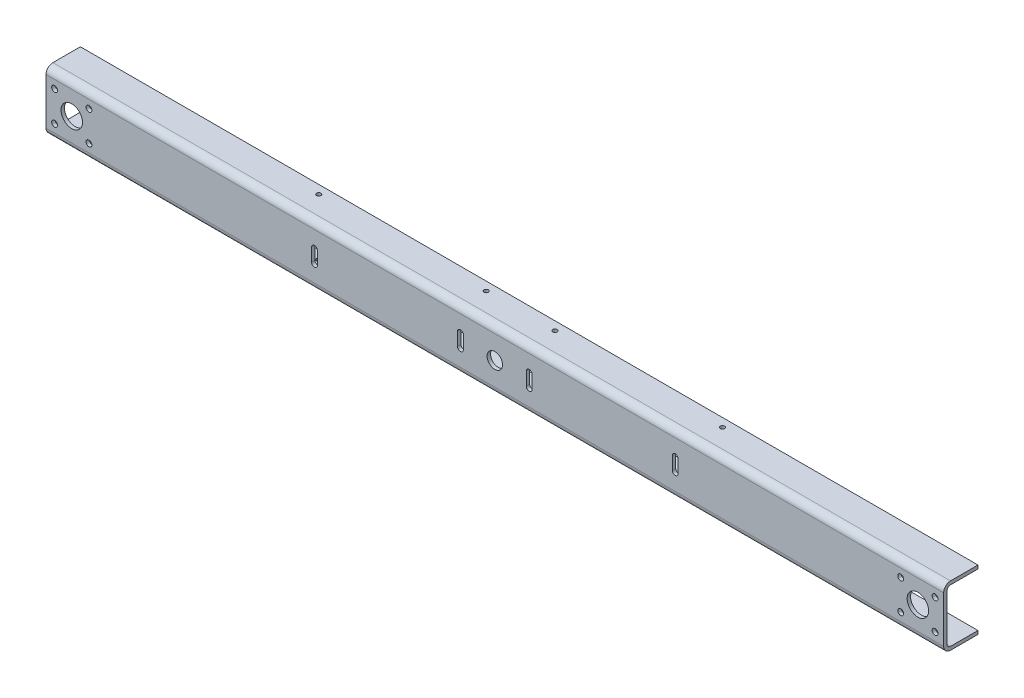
ISO-10303-21;
HEADER;
FILE_DESCRIPTION(('STEP AP214'),'2;1');
FILE_NAME('part.step','',(''),(''),'','','');
FILE_SCHEMA(('AUTOMOTIVE_DESIGN { 1 0 10303 214 1 1 1 1 }'));
ENDSEC;
DATA;
#1=APPLICATION_CONTEXT('core data for automotive mechanical design processes');
#2=APPLICATION_PROTOCOL_DEFINITION('international standard','automotive_design',2000,#1);
#3=PRODUCT_CONTEXT('',#1,'mechanical');
#4=PRODUCT('Part','Part','',(#3));
#5=PRODUCT_RELATED_PRODUCT_CATEGORY('part','',(#4));
#6=PRODUCT_DEFINITION_FORMATION('','',#4);
#7=PRODUCT_DEFINITION_CONTEXT('part definition',#1,'design');
#8=PRODUCT_DEFINITION('design','',#6,#7);
#9=PRODUCT_DEFINITION_SHAPE('','',#8);
#10=(LENGTH_UNIT() NAMED_UNIT(*) SI_UNIT(.MILLI.,.METRE.));
#11=(NAMED_UNIT(*) PLANE_ANGLE_UNIT() SI_UNIT($,.RADIAN.));
#12=(NAMED_UNIT(*) SI_UNIT($,.STERADIAN.) SOLID_ANGLE_UNIT());
#13=UNCERTAINTY_MEASURE_WITH_UNIT(LENGTH_MEASURE(1.E-05),#10,'distance_accuracy_value','');
#14=(GEOMETRIC_REPRESENTATION_CONTEXT(3) GLOBAL_UNCERTAINTY_ASSIGNED_CONTEXT((#13)) GLOBAL_UNIT_ASSIGNED_CONTEXT((#10,
#11,#12)) REPRESENTATION_CONTEXT('',''));
#15=CARTESIAN_POINT('',(0.,0.,0.));
#16=DIRECTION('',(0.,0.,1.));
#17=DIRECTION('',(1.,0.,0.));
#18=AXIS2_PLACEMENT_3D('',#15,#16,#17);
#19=CARTESIAN_POINT('',(522.5,35.,0.));
#20=DIRECTION('',(0.,0.,1.));
#21=DIRECTION('',(1.,0.,0.));
#22=AXIS2_PLACEMENT_3D('',#19,#20,#21);
#23=PLANE('',#22);
#24=CARTESIAN_POINT('',(512.5,17.5,0.));
#25=DIRECTION('',(0.,0.,-1.));
#26=DIRECTION('',(-1.,0.,0.));
#27=AXIS2_PLACEMENT_3D('',#24,#25,#26);
#28=CIRCLE('',#27,3.40000000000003);
#29=CARTESIAN_POINT('',(509.1,17.5,0.));
#30=VERTEX_POINT('',#29);
#31=EDGE_CURVE('E723',#30,#30,#28,.T.);
#32=ORIENTED_EDGE('',*,*,#31,.T.);
#33=EDGE_LOOP('',(#32));
#34=FACE_BOUND('',#33,.T.);
#35=CARTESIAN_POINT('',(472.5,17.5,0.));
#36=DIRECTION('',(0.,0.,-1.));
#37=DIRECTION('',(-1.,0.,0.));
#38=AXIS2_PLACEMENT_3D('',#35,#36,#37);
#39=CIRCLE('',#38,3.40000000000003);
#40=CARTESIAN_POINT('',(469.1,17.5,0.));
#41=VERTEX_POINT('',#40);
#42=EDGE_CURVE('E739',#41,#41,#39,.T.);
#43=ORIENTED_EDGE('',*,*,#42,.T.);
#44=EDGE_LOOP('',(#43));
#45=FACE_BOUND('',#44,.T.);
#46=DIRECTION('',(0.,1.,0.));
#47=VECTOR('',#46,1.);
#48=CARTESIAN_POINT('',(206.6,7.6,0.));
#49=LINE('',#48,#47);
#50=CARTESIAN_POINT('',(206.6,-7.6,0.));
#51=VERTEX_POINT('',#50);
#52=CARTESIAN_POINT('',(206.6,7.6,0.));
#53=VERTEX_POINT('',#52);
#54=EDGE_CURVE('E266',#51,#53,#49,.T.);
#55=ORIENTED_EDGE('',*,*,#54,.T.);
#56=CARTESIAN_POINT('',(210.,7.6,0.));
#57=DIRECTION('',(0.,0.,-1.));
#58=DIRECTION('',(-1.,0.,0.));
#59=AXIS2_PLACEMENT_3D('',#56,#57,#58);
#60=CIRCLE('',#59,3.4);
#61=CARTESIAN_POINT('',(213.4,7.6,0.));
#62=VERTEX_POINT('',#61);
#63=EDGE_CURVE('E72',#53,#62,#60,.T.);
#64=ORIENTED_EDGE('',*,*,#63,.T.);
#65=DIRECTION('',(0.,-1.,0.));
#66=VECTOR('',#65,1.);
#67=CARTESIAN_POINT('',(213.4,7.6,0.));
#68=LINE('',#67,#66);
#69=CARTESIAN_POINT('',(213.4,-7.6,0.));
#70=VERTEX_POINT('',#69);
#71=EDGE_CURVE('E255',#62,#70,#68,.T.);
#72=ORIENTED_EDGE('',*,*,#71,.T.);
#73=CARTESIAN_POINT('',(210.,-7.6,0.));
#74=DIRECTION('',(0.,0.,-1.));
#75=DIRECTION('',(-1.,0.,0.));
#76=AXIS2_PLACEMENT_3D('',#73,#74,#75);
#77=CIRCLE('',#76,3.4);
#78=EDGE_CURVE('E275',#70,#51,#77,.T.);
#79=ORIENTED_EDGE('',*,*,#78,.T.);
#80=EDGE_LOOP('',(#55,#64,#72,#79));
#81=FACE_BOUND('',#80,.T.);
#82=DIRECTION('',(0.,1.,0.));
#83=VECTOR('',#82,1.);
#84=CARTESIAN_POINT('',(-522.5,35.,0.));
#85=LINE('',#84,#83);
#86=CARTESIAN_POINT('',(-522.5,-27.,0.));
#87=VERTEX_POINT('',#86);
#88=CARTESIAN_POINT('',(-522.5,27.,0.));
#89=VERTEX_POINT('',#88);
#90=EDGE_CURVE('E480',#87,#89,#85,.T.);
#91=ORIENTED_EDGE('',*,*,#90,.F.);
#92=DIRECTION('',(-1.,0.,0.));
#93=VECTOR('',#92,1.);
#94=CARTESIAN_POINT('',(522.5,-27.,0.));
#95=LINE('',#94,#93);
#96=CARTESIAN_POINT('',(522.5,-27.,0.));
#97=VERTEX_POINT('',#96);
#98=EDGE_CURVE('E576',#97,#87,#95,.T.);
#99=ORIENTED_EDGE('',*,*,#98,.F.);
#100=DIRECTION('',(0.,1.,0.));
#101=VECTOR('',#100,1.);
#102=CARTESIAN_POINT('',(522.5,35.,0.));
#103=LINE('',#102,#101);
#104=CARTESIAN_POINT('',(522.5,27.,0.));
#105=VERTEX_POINT('',#104);
#106=EDGE_CURVE('E523',#97,#105,#103,.T.);
#107=ORIENTED_EDGE('',*,*,#106,.T.);
#108=DIRECTION('',(-1.,0.,0.));
#109=VECTOR('',#108,1.);
#110=CARTESIAN_POINT('',(522.5,27.,0.));
#111=LINE('',#110,#109);
#112=EDGE_CURVE('E579',#105,#89,#111,.T.);
#113=ORIENTED_EDGE('',*,*,#112,.T.);
#114=EDGE_LOOP('',(#91,#99,#107,#113));
#115=FACE_BOUND('',#114,.T.);
#116=CARTESIAN_POINT('',(-40.,7.6,0.));
#117=DIRECTION('',(0.,0.,1.));
#118=DIRECTION('',(1.,0.,0.));
#119=AXIS2_PLACEMENT_3D('',#116,#117,#118);
#120=CIRCLE('',#119,3.4);
#121=CARTESIAN_POINT('',(-36.6,7.6,0.));
#122=VERTEX_POINT('',#121);
#123=CARTESIAN_POINT('',(-43.4,7.6,0.));
#124=VERTEX_POINT('',#123);
#125=EDGE_CURVE('E432',#122,#124,#120,.T.);
#126=ORIENTED_EDGE('',*,*,#125,.F.);
#127=DIRECTION('',(0.,1.,0.));
#128=VECTOR('',#127,1.);
#129=CARTESIAN_POINT('',(-36.6,7.6,0.));
#130=LINE('',#129,#128);
#131=CARTESIAN_POINT('',(-36.6,-7.6,0.));
#132=VERTEX_POINT('',#131);
#133=EDGE_CURVE('E443',#132,#122,#130,.T.);
#134=ORIENTED_EDGE('',*,*,#133,.F.);
#135=CARTESIAN_POINT('',(-40.,-7.6,0.));
#136=DIRECTION('',(0.,0.,1.));
#137=DIRECTION('',(1.,0.,0.));
#138=AXIS2_PLACEMENT_3D('',#135,#136,#137);
#139=CIRCLE('',#138,3.4);
#140=CARTESIAN_POINT('',(-43.4,-7.6,0.));
#141=VERTEX_POINT('',#140);
#142=EDGE_CURVE('E439',#141,#132,#139,.T.);
#143=ORIENTED_EDGE('',*,*,#142,.F.);
#144=DIRECTION('',(0.,-1.,0.));
#145=VECTOR('',#144,1.);
#146=CARTESIAN_POINT('',(-43.4,7.6,0.));
#147=LINE('',#146,#145);
#148=EDGE_CURVE('E435',#124,#141,#147,.T.);
#149=ORIENTED_EDGE('',*,*,#148,.F.);
#150=EDGE_LOOP('',(#126,#134,#143,#149));
#151=FACE_BOUND('',#150,.T.);
#152=CARTESIAN_POINT('',(-210.,7.6,0.));
#153=DIRECTION('',(0.,0.,1.));
#154=DIRECTION('',(1.,0.,0.));
#155=AXIS2_PLACEMENT_3D('',#152,#153,#154);
#156=CIRCLE('',#155,3.4);
#157=CARTESIAN_POINT('',(-206.6,7.6,0.));
#158=VERTEX_POINT('',#157);
#159=CARTESIAN_POINT('',(-213.4,7.6,0.));
#160=VERTEX_POINT('',#159);
#161=EDGE_CURVE('E419',#158,#160,#156,.T.);
#162=ORIENTED_EDGE('',*,*,#161,.F.);
#163=DIRECTION('',(0.,1.,0.));
#164=VECTOR('',#163,1.);
#165=CARTESIAN_POINT('',(-206.6,7.6,0.));
#166=LINE('',#165,#164);
#167=CARTESIAN_POINT('',(-206.6,-7.6,0.));
#168=VERTEX_POINT('',#167);
#169=EDGE_CURVE('E408',#168,#158,#166,.T.);
#170=ORIENTED_EDGE('',*,*,#169,.F.);
#171=CARTESIAN_POINT('',(-210.,-7.6,0.));
#172=DIRECTION('',(0.,0.,1.));
#173=DIRECTION('',(1.,0.,0.));
#174=AXIS2_PLACEMENT_3D('',#171,#172,#173);
#175=CIRCLE('',#174,3.4);
#176=CARTESIAN_POINT('',(-213.4,-7.6,0.));
#177=VERTEX_POINT('',#176);
#178=EDGE_CURVE('E397',#177,#168,#175,.T.);
#179=ORIENTED_EDGE('',*,*,#178,.F.);
#180=DIRECTION('',(0.,-1.,0.));
#181=VECTOR('',#180,1.);
#182=CARTESIAN_POINT('',(-213.4,7.6,0.));
#183=LINE('',#182,#181);
#184=EDGE_CURVE('E383',#160,#177,#183,.T.);
#185=ORIENTED_EDGE('',*,*,#184,.F.);
#186=EDGE_LOOP('',(#162,#170,#179,#185));
#187=FACE_BOUND('',#186,.T.);
#188=CARTESIAN_POINT('',(0.,0.,0.));
#189=DIRECTION('',(0.,0.,1.));
#190=DIRECTION('',(1.,0.,0.));
#191=AXIS2_PLACEMENT_3D('',#188,#189,#190);
#192=CIRCLE('',#191,9.00000000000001);
#193=CARTESIAN_POINT('',(9.00000000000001,0.,0.));
#194=VERTEX_POINT('',#193);
#195=EDGE_CURVE('E372',#194,#194,#192,.T.);
#196=ORIENTED_EDGE('',*,*,#195,.F.);
#197=EDGE_LOOP('',(#196));
#198=FACE_BOUND('',#197,.T.);
#199=CARTESIAN_POINT('',(-492.5,0.,0.));
#200=DIRECTION('',(0.,0.,1.));
#201=DIRECTION('',(1.,0.,0.));
#202=AXIS2_PLACEMENT_3D('',#199,#200,#201);
#203=CIRCLE('',#202,12.5);
#204=CARTESIAN_POINT('',(-480.,0.,0.));
#205=VERTEX_POINT('',#204);
#206=EDGE_CURVE('E365',#205,#205,#203,.T.);
#207=ORIENTED_EDGE('',*,*,#206,.F.);
#208=EDGE_LOOP('',(#207));
#209=FACE_BOUND('',#208,.T.);
#210=CARTESIAN_POINT('',(-472.5,17.5,0.));
#211=DIRECTION('',(0.,0.,1.));
#212=DIRECTION('',(1.,0.,0.));
#213=AXIS2_PLACEMENT_3D('',#210,#211,#212);
#214=CIRCLE('',#213,3.40000000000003);
#215=CARTESIAN_POINT('',(-469.1,17.5,0.));
#216=VERTEX_POINT('',#215);
#217=EDGE_CURVE('E357',#216,#216,#214,.T.);
#218=ORIENTED_EDGE('',*,*,#217,.F.);
#219=EDGE_LOOP('',(#218));
#220=FACE_BOUND('',#219,.T.);
#221=CARTESIAN_POINT('',(-472.5,-17.5,0.));
#222=DIRECTION('',(0.,0.,1.));
#223=DIRECTION('',(1.,0.,0.));
#224=AXIS2_PLACEMENT_3D('',#221,#222,#223);
#225=CIRCLE('',#224,3.40000000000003);
#226=CARTESIAN_POINT('',(-469.1,-17.5,0.));
#227=VERTEX_POINT('',#226);
#228=EDGE_CURVE('E349',#227,#227,#225,.T.);
#229=ORIENTED_EDGE('',*,*,#228,.F.);
#230=EDGE_LOOP('',(#229));
#231=FACE_BOUND('',#230,.T.);
#232=CARTESIAN_POINT('',(-512.5,17.5,0.));
#233=DIRECTION('',(0.,0.,1.));
#234=DIRECTION('',(1.,0.,0.));
#235=AXIS2_PLACEMENT_3D('',#232,#233,#234);
#236=CIRCLE('',#235,3.40000000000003);
#237=CARTESIAN_POINT('',(-509.1,17.5,0.));
#238=VERTEX_POINT('',#237);
#239=EDGE_CURVE('E341',#238,#238,#236,.T.);
#240=ORIENTED_EDGE('',*,*,#239,.F.);
#241=EDGE_LOOP('',(#240));
#242=FACE_BOUND('',#241,.T.);
#243=CARTESIAN_POINT('',(-512.5,-17.5,0.));
#244=DIRECTION('',(0.,0.,1.));
#245=DIRECTION('',(1.,0.,0.));
#246=AXIS2_PLACEMENT_3D('',#243,#244,#245);
#247=CIRCLE('',#246,3.40000000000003);
#248=CARTESIAN_POINT('',(-509.1,-17.5,0.));
#249=VERTEX_POINT('',#248);
#250=EDGE_CURVE('E333',#249,#249,#247,.T.);
#251=ORIENTED_EDGE('',*,*,#250,.F.);
#252=EDGE_LOOP('',(#251));
#253=FACE_BOUND('',#252,.T.);
#254=DIRECTION('',(0.,1.,0.));
#255=VECTOR('',#254,1.);
#256=CARTESIAN_POINT('',(36.6,7.6,0.));
#257=LINE('',#256,#255);
#258=CARTESIAN_POINT('',(36.6,-7.6,0.));
#259=VERTEX_POINT('',#258);
#260=CARTESIAN_POINT('',(36.6,7.6,0.));
#261=VERTEX_POINT('',#260);
#262=EDGE_CURVE('E304',#259,#261,#257,.T.);
#263=ORIENTED_EDGE('',*,*,#262,.T.);
#264=CARTESIAN_POINT('',(40.,7.6,0.));
#265=DIRECTION('',(0.,0.,-1.));
#266=DIRECTION('',(-1.,0.,0.));
#267=AXIS2_PLACEMENT_3D('',#264,#265,#266);
#268=CIRCLE('',#267,3.4);
#269=CARTESIAN_POINT('',(43.4,7.6,0.));
#270=VERTEX_POINT('',#269);
#271=EDGE_CURVE('E300',#261,#270,#268,.T.);
#272=ORIENTED_EDGE('',*,*,#271,.T.);
#273=DIRECTION('',(0.,-1.,0.));
#274=VECTOR('',#273,1.);
#275=CARTESIAN_POINT('',(43.4,7.6,0.));
#276=LINE('',#275,#274);
#277=CARTESIAN_POINT('',(43.4,-7.6,0.));
#278=VERTEX_POINT('',#277);
#279=EDGE_CURVE('E312',#270,#278,#276,.T.);
#280=ORIENTED_EDGE('',*,*,#279,.T.);
#281=CARTESIAN_POINT('',(40.,-7.6,0.));
#282=DIRECTION('',(0.,0.,-1.));
#283=DIRECTION('',(-1.,0.,0.));
#284=AXIS2_PLACEMENT_3D('',#281,#282,#283);
#285=CIRCLE('',#284,3.4);
#286=EDGE_CURVE('E308',#278,#259,#285,.T.);
#287=ORIENTED_EDGE('',*,*,#286,.T.);
#288=EDGE_LOOP('',(#263,#272,#280,#287));
#289=FACE_BOUND('',#288,.T.);
#290=CARTESIAN_POINT('',(492.5,0.,0.));
#291=DIRECTION('',(0.,0.,-1.));
#292=DIRECTION('',(-1.,0.,0.));
#293=AXIS2_PLACEMENT_3D('',#290,#291,#292);
#294=CIRCLE('',#293,12.5);
#295=CARTESIAN_POINT('',(480.,0.,0.));
#296=VERTEX_POINT('',#295);
#297=EDGE_CURVE('E747',#296,#296,#294,.T.);
#298=ORIENTED_EDGE('',*,*,#297,.T.);
#299=EDGE_LOOP('',(#298));
#300=FACE_BOUND('',#299,.T.);
#301=CARTESIAN_POINT('',(472.5,-17.5,0.));
#302=DIRECTION('',(0.,0.,-1.));
#303=DIRECTION('',(-1.,0.,0.));
#304=AXIS2_PLACEMENT_3D('',#301,#302,#303);
#305=CIRCLE('',#304,3.40000000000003);
#306=CARTESIAN_POINT('',(469.1,-17.5,0.));
#307=VERTEX_POINT('',#306);
#308=EDGE_CURVE('E731',#307,#307,#305,.T.);
#309=ORIENTED_EDGE('',*,*,#308,.T.);
#310=EDGE_LOOP('',(#309));
#311=FACE_BOUND('',#310,.T.);
#312=CARTESIAN_POINT('',(512.5,-17.5,0.));
#313=DIRECTION('',(0.,0.,-1.));
#314=DIRECTION('',(-1.,0.,0.));
#315=AXIS2_PLACEMENT_3D('',#312,#313,#314);
#316=CIRCLE('',#315,3.40000000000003);
#317=CARTESIAN_POINT('',(509.1,-17.5,0.));
#318=VERTEX_POINT('',#317);
#319=EDGE_CURVE('E715',#318,#318,#316,.T.);
#320=ORIENTED_EDGE('',*,*,#319,.T.);
#321=EDGE_LOOP('',(#320));
#322=FACE_BOUND('',#321,.T.);
#323=ADVANCED_FACE('F54',(#34,#45,#81,#115,#151,#187,#198,#209,#220,#231,#242,#253,#289,#300,
#311,#322),#23,.T.);
#324=CARTESIAN_POINT('',(522.5,35.,-4.));
#325=DIRECTION('',(0.,0.,1.));
#326=DIRECTION('',(1.,0.,0.));
#327=AXIS2_PLACEMENT_3D('',#324,#325,#326);
#328=PLANE('',#327);
#329=CARTESIAN_POINT('',(512.5,17.5,-4.));
#330=DIRECTION('',(0.,0.,1.));
#331=DIRECTION('',(1.,0.,0.));
#332=AXIS2_PLACEMENT_3D('',#329,#330,#331);
#333=CIRCLE('',#332,3.40000000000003);
#334=CARTESIAN_POINT('',(515.9,17.5,-4.));
#335=VERTEX_POINT('',#334);
#336=EDGE_CURVE('E719',#335,#335,#333,.T.);
#337=ORIENTED_EDGE('',*,*,#336,.T.);
#338=EDGE_LOOP('',(#337));
#339=FACE_BOUND('',#338,.T.);
#340=CARTESIAN_POINT('',(472.5,17.5,-4.));
#341=DIRECTION('',(0.,0.,1.));
#342=DIRECTION('',(1.,0.,0.));
#343=AXIS2_PLACEMENT_3D('',#340,#341,#342);
#344=CIRCLE('',#343,3.40000000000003);
#345=CARTESIAN_POINT('',(475.9,17.5,-4.));
#346=VERTEX_POINT('',#345);
#347=EDGE_CURVE('E735',#346,#346,#344,.T.);
#348=ORIENTED_EDGE('',*,*,#347,.T.);
#349=EDGE_LOOP('',(#348));
#350=FACE_BOUND('',#349,.T.);
#351=CARTESIAN_POINT('',(210.,7.6,-4.));
#352=DIRECTION('',(0.,0.,1.));
#353=DIRECTION('',(1.,0.,0.));
#354=AXIS2_PLACEMENT_3D('',#351,#352,#353);
#355=CIRCLE('',#354,3.4);
#356=CARTESIAN_POINT('',(213.4,7.6,-4.));
#357=VERTEX_POINT('',#356);
#358=CARTESIAN_POINT('',(206.6,7.6,-4.));
#359=VERTEX_POINT('',#358);
#360=EDGE_CURVE('E252',#357,#359,#355,.T.);
#361=ORIENTED_EDGE('',*,*,#360,.T.);
#362=DIRECTION('',(0.,-1.,0.));
#363=VECTOR('',#362,1.);
#364=CARTESIAN_POINT('',(206.6,7.6,-4.));
#365=LINE('',#364,#363);
#366=CARTESIAN_POINT('',(206.6,-7.6,-4.));
#367=VERTEX_POINT('',#366);
#368=EDGE_CURVE('E240',#359,#367,#365,.T.);
#369=ORIENTED_EDGE('',*,*,#368,.T.);
#370=CARTESIAN_POINT('',(210.,-7.6,-4.));
#371=DIRECTION('',(0.,0.,1.));
#372=DIRECTION('',(1.,0.,0.));
#373=AXIS2_PLACEMENT_3D('',#370,#371,#372);
#374=CIRCLE('',#373,3.4);
#375=CARTESIAN_POINT('',(213.4,-7.6,-4.));
#376=VERTEX_POINT('',#375);
#377=EDGE_CURVE('E269',#367,#376,#374,.T.);
#378=ORIENTED_EDGE('',*,*,#377,.T.);
#379=DIRECTION('',(0.,1.,0.));
#380=VECTOR('',#379,1.);
#381=CARTESIAN_POINT('',(213.4,7.6,-4.));
#382=LINE('',#381,#380);
#383=EDGE_CURVE('E260',#376,#357,#382,.T.);
#384=ORIENTED_EDGE('',*,*,#383,.T.);
#385=EDGE_LOOP('',(#361,#369,#378,#384));
#386=FACE_BOUND('',#385,.T.);
#387=DIRECTION('',(0.,-1.,0.));
#388=VECTOR('',#387,1.);
#389=CARTESIAN_POINT('',(-522.5,35.,-4.));
#390=LINE('',#389,#388);
#391=CARTESIAN_POINT('',(-522.5,-27.,-4.));
#392=VERTEX_POINT('',#391);
#393=CARTESIAN_POINT('',(-522.5,27.,-4.));
#394=VERTEX_POINT('',#393);
#395=EDGE_CURVE('E502',#392,#394,#390,.F.);
#396=ORIENTED_EDGE('',*,*,#395,.T.);
#397=DIRECTION('',(-1.,0.,0.));
#398=VECTOR('',#397,1.);
#399=CARTESIAN_POINT('',(522.5,27.,-4.));
#400=LINE('',#399,#398);
#401=CARTESIAN_POINT('',(522.5,27.,-4.));
#402=VERTEX_POINT('',#401);
#403=EDGE_CURVE('E555',#402,#394,#400,.T.);
#404=ORIENTED_EDGE('',*,*,#403,.F.);
#405=DIRECTION('',(0.,-1.,0.));
#406=VECTOR('',#405,1.);
#407=CARTESIAN_POINT('',(522.5,35.,-4.));
#408=LINE('',#407,#406);
#409=CARTESIAN_POINT('',(522.5,-27.,-4.));
#410=VERTEX_POINT('',#409);
#411=EDGE_CURVE('E545',#410,#402,#408,.F.);
#412=ORIENTED_EDGE('',*,*,#411,.F.);
#413=DIRECTION('',(-1.,0.,0.));
#414=VECTOR('',#413,1.);
#415=CARTESIAN_POINT('',(522.5,-27.,-4.));
#416=LINE('',#415,#414);
#417=EDGE_CURVE('E559',#410,#392,#416,.T.);
#418=ORIENTED_EDGE('',*,*,#417,.T.);
#419=EDGE_LOOP('',(#396,#404,#412,#418));
#420=FACE_BOUND('',#419,.T.);
#421=DIRECTION('',(0.,-1.,0.));
#422=VECTOR('',#421,1.);
#423=CARTESIAN_POINT('',(-36.6,7.6,-4.));
#424=LINE('',#423,#422);
#425=CARTESIAN_POINT('',(-36.6,7.6,-4.));
#426=VERTEX_POINT('',#425);
#427=CARTESIAN_POINT('',(-36.6,-7.6,-4.));
#428=VERTEX_POINT('',#427);
#429=EDGE_CURVE('E424',#426,#428,#424,.T.);
#430=ORIENTED_EDGE('',*,*,#429,.F.);
#431=CARTESIAN_POINT('',(-40.,7.6,-4.));
#432=DIRECTION('',(0.,0.,1.));
#433=DIRECTION('',(1.,0.,0.));
#434=AXIS2_PLACEMENT_3D('',#431,#432,#433);
#435=CIRCLE('',#434,3.4);
#436=CARTESIAN_POINT('',(-43.4,7.6,-4.));
#437=VERTEX_POINT('',#436);
#438=EDGE_CURVE('E428',#437,#426,#435,.F.);
#439=ORIENTED_EDGE('',*,*,#438,.F.);
#440=DIRECTION('',(0.,1.,0.));
#441=VECTOR('',#440,1.);
#442=CARTESIAN_POINT('',(-43.4,7.6,-4.));
#443=LINE('',#442,#441);
#444=CARTESIAN_POINT('',(-43.4,-7.6,-4.));
#445=VERTEX_POINT('',#444);
#446=EDGE_CURVE('E451',#445,#437,#443,.T.);
#447=ORIENTED_EDGE('',*,*,#446,.F.);
#448=CARTESIAN_POINT('',(-40.,-7.6,-4.));
#449=DIRECTION('',(0.,0.,1.));
#450=DIRECTION('',(1.,0.,0.));
#451=AXIS2_PLACEMENT_3D('',#448,#449,#450);
#452=CIRCLE('',#451,3.4);
#453=EDGE_CURVE('E422',#428,#445,#452,.F.);
#454=ORIENTED_EDGE('',*,*,#453,.F.);
#455=EDGE_LOOP('',(#430,#439,#447,#454));
#456=FACE_BOUND('',#455,.T.);
#457=DIRECTION('',(0.,-1.,0.));
#458=VECTOR('',#457,1.);
#459=CARTESIAN_POINT('',(-206.6,7.6,-4.));
#460=LINE('',#459,#458);
#461=CARTESIAN_POINT('',(-206.6,7.6,-4.));
#462=VERTEX_POINT('',#461);
#463=CARTESIAN_POINT('',(-206.6,-7.6,-4.));
#464=VERTEX_POINT('',#463);
#465=EDGE_CURVE('E404',#462,#464,#460,.T.);
#466=ORIENTED_EDGE('',*,*,#465,.F.);
#467=CARTESIAN_POINT('',(-210.,7.6,-4.));
#468=DIRECTION('',(0.,0.,1.));
#469=DIRECTION('',(1.,0.,0.));
#470=AXIS2_PLACEMENT_3D('',#467,#468,#469);
#471=CIRCLE('',#470,3.4);
#472=CARTESIAN_POINT('',(-213.4,7.6,-4.));
#473=VERTEX_POINT('',#472);
#474=EDGE_CURVE('E415',#473,#462,#471,.F.);
#475=ORIENTED_EDGE('',*,*,#474,.F.);
#476=DIRECTION('',(0.,1.,0.));
#477=VECTOR('',#476,1.);
#478=CARTESIAN_POINT('',(-213.4,7.6,-4.));
#479=LINE('',#478,#477);
#480=CARTESIAN_POINT('',(-213.4,-7.6,-4.));
#481=VERTEX_POINT('',#480);
#482=EDGE_CURVE('E380',#481,#473,#479,.T.);
#483=ORIENTED_EDGE('',*,*,#482,.F.);
#484=CARTESIAN_POINT('',(-210.,-7.6,-4.));
#485=DIRECTION('',(0.,0.,1.));
#486=DIRECTION('',(1.,0.,0.));
#487=AXIS2_PLACEMENT_3D('',#484,#485,#486);
#488=CIRCLE('',#487,3.4);
#489=EDGE_CURVE('E394',#464,#481,#488,.F.);
#490=ORIENTED_EDGE('',*,*,#489,.F.);
#491=EDGE_LOOP('',(#466,#475,#483,#490));
#492=FACE_BOUND('',#491,.T.);
#493=CARTESIAN_POINT('',(0.,0.,-4.));
#494=DIRECTION('',(0.,0.,1.));
#495=DIRECTION('',(1.,0.,0.));
#496=AXIS2_PLACEMENT_3D('',#493,#494,#495);
#497=CIRCLE('',#496,9.00000000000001);
#498=CARTESIAN_POINT('',(9.00000000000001,0.,-4.));
#499=VERTEX_POINT('',#498);
#500=EDGE_CURVE('E376',#499,#499,#497,.F.);
#501=ORIENTED_EDGE('',*,*,#500,.F.);
#502=EDGE_LOOP('',(#501));
#503=FACE_BOUND('',#502,.T.);
#504=CARTESIAN_POINT('',(-492.5,0.,-4.));
#505=DIRECTION('',(0.,0.,1.));
#506=DIRECTION('',(1.,0.,0.));
#507=AXIS2_PLACEMENT_3D('',#504,#505,#506);
#508=CIRCLE('',#507,12.5);
#509=CARTESIAN_POINT('',(-480.,0.,-4.));
#510=VERTEX_POINT('',#509);
#511=EDGE_CURVE('E368',#510,#510,#508,.F.);
#512=ORIENTED_EDGE('',*,*,#511,.F.);
#513=EDGE_LOOP('',(#512));
#514=FACE_BOUND('',#513,.T.);
#515=CARTESIAN_POINT('',(-472.5,17.5,-4.));
#516=DIRECTION('',(0.,0.,1.));
#517=DIRECTION('',(1.,0.,0.));
#518=AXIS2_PLACEMENT_3D('',#515,#516,#517);
#519=CIRCLE('',#518,3.40000000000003);
#520=CARTESIAN_POINT('',(-469.1,17.5,-4.));
#521=VERTEX_POINT('',#520);
#522=EDGE_CURVE('E361',#521,#521,#519,.F.);
#523=ORIENTED_EDGE('',*,*,#522,.F.);
#524=EDGE_LOOP('',(#523));
#525=FACE_BOUND('',#524,.T.);
#526=CARTESIAN_POINT('',(-472.5,-17.5,-4.));
#527=DIRECTION('',(0.,0.,1.));
#528=DIRECTION('',(1.,0.,0.));
#529=AXIS2_PLACEMENT_3D('',#526,#527,#528);
#530=CIRCLE('',#529,3.40000000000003);
#531=CARTESIAN_POINT('',(-469.1,-17.5,-4.));
#532=VERTEX_POINT('',#531);
#533=EDGE_CURVE('E353',#532,#532,#530,.F.);
#534=ORIENTED_EDGE('',*,*,#533,.F.);
#535=EDGE_LOOP('',(#534));
#536=FACE_BOUND('',#535,.T.);
#537=CARTESIAN_POINT('',(-512.5,17.5,-4.));
#538=DIRECTION('',(0.,0.,1.));
#539=DIRECTION('',(1.,0.,0.));
#540=AXIS2_PLACEMENT_3D('',#537,#538,#539);
#541=CIRCLE('',#540,3.40000000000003);
#542=CARTESIAN_POINT('',(-509.1,17.5,-4.));
#543=VERTEX_POINT('',#542);
#544=EDGE_CURVE('E345',#543,#543,#541,.F.);
#545=ORIENTED_EDGE('',*,*,#544,.F.);
#546=EDGE_LOOP('',(#545));
#547=FACE_BOUND('',#546,.T.);
#548=CARTESIAN_POINT('',(-512.5,-17.5,-4.));
#549=DIRECTION('',(0.,0.,1.));
#550=DIRECTION('',(1.,0.,0.));
#551=AXIS2_PLACEMENT_3D('',#548,#549,#550);
#552=CIRCLE('',#551,3.40000000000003);
#553=CARTESIAN_POINT('',(-509.1,-17.5,-4.));
#554=VERTEX_POINT('',#553);
#555=EDGE_CURVE('E337',#554,#554,#552,.F.);
#556=ORIENTED_EDGE('',*,*,#555,.F.);
#557=EDGE_LOOP('',(#556));
#558=FACE_BOUND('',#557,.T.);
#559=CARTESIAN_POINT('',(40.,7.6,-4.));
#560=DIRECTION('',(0.,0.,1.));
#561=DIRECTION('',(1.,0.,0.));
#562=AXIS2_PLACEMENT_3D('',#559,#560,#561);
#563=CIRCLE('',#562,3.4);
#564=CARTESIAN_POINT('',(43.4,7.6,-4.));
#565=VERTEX_POINT('',#564);
#566=CARTESIAN_POINT('',(36.6,7.6,-4.));
#567=VERTEX_POINT('',#566);
#568=EDGE_CURVE('E296',#565,#567,#563,.T.);
#569=ORIENTED_EDGE('',*,*,#568,.T.);
#570=DIRECTION('',(0.,-1.,0.));
#571=VECTOR('',#570,1.);
#572=CARTESIAN_POINT('',(36.6,7.6,-4.));
#573=LINE('',#572,#571);
#574=CARTESIAN_POINT('',(36.6,-7.6,-4.));
#575=VERTEX_POINT('',#574);
#576=EDGE_CURVE('E320',#567,#575,#573,.T.);
#577=ORIENTED_EDGE('',*,*,#576,.T.);
#578=CARTESIAN_POINT('',(40.,-7.6,-4.));
#579=DIRECTION('',(0.,0.,1.));
#580=DIRECTION('',(1.,0.,0.));
#581=AXIS2_PLACEMENT_3D('',#578,#579,#580);
#582=CIRCLE('',#581,3.4);
#583=CARTESIAN_POINT('',(43.4,-7.6,-4.));
#584=VERTEX_POINT('',#583);
#585=EDGE_CURVE('E248',#575,#584,#582,.T.);
#586=ORIENTED_EDGE('',*,*,#585,.T.);
#587=DIRECTION('',(0.,1.,0.));
#588=VECTOR('',#587,1.);
#589=CARTESIAN_POINT('',(43.4,7.6,-4.));
#590=LINE('',#589,#588);
#591=EDGE_CURVE('E292',#584,#565,#590,.T.);
#592=ORIENTED_EDGE('',*,*,#591,.T.);
#593=EDGE_LOOP('',(#569,#577,#586,#592));
#594=FACE_BOUND('',#593,.T.);
#595=CARTESIAN_POINT('',(492.5,0.,-4.));
#596=DIRECTION('',(0.,0.,1.));
#597=DIRECTION('',(1.,0.,0.));
#598=AXIS2_PLACEMENT_3D('',#595,#596,#597);
#599=CIRCLE('',#598,12.5);
#600=CARTESIAN_POINT('',(505.,0.,-4.));
#601=VERTEX_POINT('',#600);
#602=EDGE_CURVE('E743',#601,#601,#599,.T.);
#603=ORIENTED_EDGE('',*,*,#602,.T.);
#604=EDGE_LOOP('',(#603));
#605=FACE_BOUND('',#604,.T.);
#606=CARTESIAN_POINT('',(472.5,-17.5,-4.));
#607=DIRECTION('',(0.,0.,1.));
#608=DIRECTION('',(1.,0.,0.));
#609=AXIS2_PLACEMENT_3D('',#606,#607,#608);
#610=CIRCLE('',#609,3.40000000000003);
#611=CARTESIAN_POINT('',(475.9,-17.5,-4.));
#612=VERTEX_POINT('',#611);
#613=EDGE_CURVE('E727',#612,#612,#610,.T.);
#614=ORIENTED_EDGE('',*,*,#613,.T.);
#615=EDGE_LOOP('',(#614));
#616=FACE_BOUND('',#615,.T.);
#617=CARTESIAN_POINT('',(512.5,-17.5,-4.));
#618=DIRECTION('',(0.,0.,1.));
#619=DIRECTION('',(1.,0.,0.));
#620=AXIS2_PLACEMENT_3D('',#617,#618,#619);
#621=CIRCLE('',#620,3.40000000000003);
#622=CARTESIAN_POINT('',(515.9,-17.5,-4.));
#623=VERTEX_POINT('',#622);
#624=EDGE_CURVE('E714',#623,#623,#621,.T.);
#625=ORIENTED_EDGE('',*,*,#624,.T.);
#626=EDGE_LOOP('',(#625));
#627=FACE_BOUND('',#626,.T.);
#628=ADVANCED_FACE('F258',(#339,#350,#386,#420,#456,#492,#503,#514,#525,#536,#547,#558,#594,
#605,#616,#627),#328,.F.);
#629=CARTESIAN_POINT('',(522.5,31.,-40.));
#630=DIRECTION('',(0.,1.,0.));
#631=DIRECTION('',(0.,0.,1.));
#632=AXIS2_PLACEMENT_3D('',#629,#630,#631);
#633=PLANE('',#632);
#634=CARTESIAN_POINT('',(-235.,31.,-30.));
#635=DIRECTION('',(0.,1.,0.));
#636=DIRECTION('',(0.,0.,1.));
#637=AXIS2_PLACEMENT_3D('',#634,#635,#636);
#638=CIRCLE('',#637,2.49999999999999);
#639=CARTESIAN_POINT('',(-235.,31.,-27.5));
#640=VERTEX_POINT('',#639);
#641=EDGE_CURVE('E686',#640,#640,#638,.T.);
#642=ORIENTED_EDGE('',*,*,#641,.T.);
#643=EDGE_LOOP('',(#642));
#644=FACE_BOUND('',#643,.T.);
#645=CARTESIAN_POINT('',(-40.,31.,-30.));
#646=DIRECTION('',(0.,1.,0.));
#647=DIRECTION('',(0.,0.,1.));
#648=AXIS2_PLACEMENT_3D('',#645,#646,#647);
#649=CIRCLE('',#648,2.49999999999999);
#650=CARTESIAN_POINT('',(-40.,31.,-27.5));
#651=VERTEX_POINT('',#650);
#652=EDGE_CURVE('E694',#651,#651,#649,.T.);
#653=ORIENTED_EDGE('',*,*,#652,.T.);
#654=EDGE_LOOP('',(#653));
#655=FACE_BOUND('',#654,.T.);
#656=CARTESIAN_POINT('',(40.,31.,-30.));
#657=DIRECTION('',(0.,1.,0.));
#658=DIRECTION('',(0.,0.,1.));
#659=AXIS2_PLACEMENT_3D('',#656,#657,#658);
#660=CIRCLE('',#659,2.49999999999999);
#661=CARTESIAN_POINT('',(40.,31.,-27.5));
#662=VERTEX_POINT('',#661);
#663=EDGE_CURVE('E702',#662,#662,#660,.T.);
#664=ORIENTED_EDGE('',*,*,#663,.T.);
#665=EDGE_LOOP('',(#664));
#666=FACE_BOUND('',#665,.T.);
#667=CARTESIAN_POINT('',(235.,31.,-30.));
#668=DIRECTION('',(0.,1.,0.));
#669=DIRECTION('',(0.,0.,1.));
#670=AXIS2_PLACEMENT_3D('',#667,#668,#669);
#671=CIRCLE('',#670,2.49999999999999);
#672=CARTESIAN_POINT('',(235.,31.,-27.5));
#673=VERTEX_POINT('',#672);
#674=EDGE_CURVE('E710',#673,#673,#671,.T.);
#675=ORIENTED_EDGE('',*,*,#674,.T.);
#676=EDGE_LOOP('',(#675));
#677=FACE_BOUND('',#676,.T.);
#678=DIRECTION('',(0.,0.,-1.));
#679=VECTOR('',#678,1.);
#680=CARTESIAN_POINT('',(-522.5,31.,-40.));
#681=LINE('',#680,#679);
#682=CARTESIAN_POINT('',(-522.5,31.,-8.));
#683=VERTEX_POINT('',#682);
#684=CARTESIAN_POINT('',(-522.5,31.,-40.));
#685=VERTEX_POINT('',#684);
#686=EDGE_CURVE('E464',#683,#685,#681,.T.);
#687=ORIENTED_EDGE('',*,*,#686,.T.);
#688=DIRECTION('',(-1.,0.,0.));
#689=VECTOR('',#688,1.);
#690=CARTESIAN_POINT('',(522.5,31.,-40.));
#691=LINE('',#690,#689);
#692=CARTESIAN_POINT('',(522.5,31.,-40.));
#693=VERTEX_POINT('',#692);
#694=EDGE_CURVE('E11',#693,#685,#691,.T.);
#695=ORIENTED_EDGE('',*,*,#694,.F.);
#696=DIRECTION('',(0.,0.,-1.));
#697=VECTOR('',#696,1.);
#698=CARTESIAN_POINT('',(522.5,31.,-40.));
#699=LINE('',#698,#697);
#700=CARTESIAN_POINT('',(522.5,31.,-8.));
#701=VERTEX_POINT('',#700);
#702=EDGE_CURVE('E508',#701,#693,#699,.T.);
#703=ORIENTED_EDGE('',*,*,#702,.F.);
#704=DIRECTION('',(-1.,0.,0.));
#705=VECTOR('',#704,1.);
#706=CARTESIAN_POINT('',(522.5,31.,-8.));
#707=LINE('',#706,#705);
#708=EDGE_CURVE('E551',#701,#683,#707,.T.);
#709=ORIENTED_EDGE('',*,*,#708,.T.);
#710=EDGE_LOOP('',(#687,#695,#703,#709));
#711=FACE_BOUND('',#710,.T.);
#712=ADVANCED_FACE('F56',(#644,#655,#666,#677,#711),#633,.F.);
#713=CARTESIAN_POINT('',(522.5,35.,-40.));
#714=DIRECTION('',(0.,0.,-1.));
#715=DIRECTION('',(-1.,0.,0.));
#716=AXIS2_PLACEMENT_3D('',#713,#714,#715);
#717=PLANE('',#716);
#718=DIRECTION('',(0.,-1.,0.));
#719=VECTOR('',#718,1.);
#720=CARTESIAN_POINT('',(-522.5,35.,-40.));
#721=LINE('',#720,#719);
#722=CARTESIAN_POINT('',(-522.5,35.,-40.));
#723=VERTEX_POINT('',#722);
#724=EDGE_CURVE('E468',#723,#685,#721,.T.);
#725=ORIENTED_EDGE('',*,*,#724,.F.);
#726=DIRECTION('',(-1.,0.,0.));
#727=VECTOR('',#726,1.);
#728=CARTESIAN_POINT('',(522.5,35.,-40.));
#729=LINE('',#728,#727);
#730=CARTESIAN_POINT('',(522.5,35.,-40.));
#731=VERTEX_POINT('',#730);
#732=EDGE_CURVE('E64',#731,#723,#729,.T.);
#733=ORIENTED_EDGE('',*,*,#732,.F.);
#734=DIRECTION('',(0.,-1.,0.));
#735=VECTOR('',#734,1.);
#736=CARTESIAN_POINT('',(522.5,35.,-40.));
#737=LINE('',#736,#735);
#738=EDGE_CURVE('E511',#731,#693,#737,.T.);
#739=ORIENTED_EDGE('',*,*,#738,.T.);
#740=ORIENTED_EDGE('',*,*,#694,.T.);
#741=EDGE_LOOP('',(#725,#733,#739,#740));
#742=FACE_BOUND('',#741,.T.);
#743=ADVANCED_FACE('F810',(#742),#717,.T.);
#744=CARTESIAN_POINT('',(522.5,35.,-40.));
#745=DIRECTION('',(0.,1.,0.));
#746=DIRECTION('',(0.,0.,1.));
#747=AXIS2_PLACEMENT_3D('',#744,#745,#746);
#748=PLANE('',#747);
#749=CARTESIAN_POINT('',(-235.,35.,-30.));
#750=DIRECTION('',(0.,1.,0.));
#751=DIRECTION('',(0.,0.,1.));
#752=AXIS2_PLACEMENT_3D('',#749,#750,#751);
#753=CIRCLE('',#752,2.5);
#754=CARTESIAN_POINT('',(-235.,35.,-27.5));
#755=VERTEX_POINT('',#754);
#756=EDGE_CURVE('E682',#755,#755,#753,.T.);
#757=ORIENTED_EDGE('',*,*,#756,.F.);
#758=EDGE_LOOP('',(#757));
#759=FACE_BOUND('',#758,.T.);
#760=CARTESIAN_POINT('',(-40.,35.,-30.));
#761=DIRECTION('',(0.,1.,0.));
#762=DIRECTION('',(0.,0.,1.));
#763=AXIS2_PLACEMENT_3D('',#760,#761,#762);
#764=CIRCLE('',#763,2.49999999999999);
#765=CARTESIAN_POINT('',(-40.,35.,-27.5));
#766=VERTEX_POINT('',#765);
#767=EDGE_CURVE('E690',#766,#766,#764,.T.);
#768=ORIENTED_EDGE('',*,*,#767,.F.);
#769=EDGE_LOOP('',(#768));
#770=FACE_BOUND('',#769,.T.);
#771=CARTESIAN_POINT('',(40.,35.,-30.));
#772=DIRECTION('',(0.,1.,0.));
#773=DIRECTION('',(0.,0.,1.));
#774=AXIS2_PLACEMENT_3D('',#771,#772,#773);
#775=CIRCLE('',#774,2.49999999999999);
#776=CARTESIAN_POINT('',(40.,35.,-27.5));
#777=VERTEX_POINT('',#776);
#778=EDGE_CURVE('E698',#777,#777,#775,.T.);
#779=ORIENTED_EDGE('',*,*,#778,.F.);
#780=EDGE_LOOP('',(#779));
#781=FACE_BOUND('',#780,.T.);
#782=CARTESIAN_POINT('',(235.,35.,-30.));
#783=DIRECTION('',(0.,1.,0.));
#784=DIRECTION('',(0.,0.,1.));
#785=AXIS2_PLACEMENT_3D('',#782,#783,#784);
#786=CIRCLE('',#785,2.5);
#787=CARTESIAN_POINT('',(235.,35.,-27.5));
#788=VERTEX_POINT('',#787);
#789=EDGE_CURVE('E706',#788,#788,#786,.T.);
#790=ORIENTED_EDGE('',*,*,#789,.F.);
#791=EDGE_LOOP('',(#790));
#792=FACE_BOUND('',#791,.T.);
#793=DIRECTION('',(0.,0.,-1.));
#794=VECTOR('',#793,1.);
#795=CARTESIAN_POINT('',(-522.5,35.,-40.));
#796=LINE('',#795,#794);
#797=CARTESIAN_POINT('',(-522.5,35.,-8.));
#798=VERTEX_POINT('',#797);
#799=EDGE_CURVE('E472',#798,#723,#796,.T.);
#800=ORIENTED_EDGE('',*,*,#799,.F.);
#801=DIRECTION('',(-1.,0.,0.));
#802=VECTOR('',#801,1.);
#803=CARTESIAN_POINT('',(522.5,35.,-8.));
#804=LINE('',#803,#802);
#805=CARTESIAN_POINT('',(522.5,35.,-8.));
#806=VERTEX_POINT('',#805);
#807=EDGE_CURVE('E582',#806,#798,#804,.T.);
#808=ORIENTED_EDGE('',*,*,#807,.F.);
#809=DIRECTION('',(0.,0.,-1.));
#810=VECTOR('',#809,1.);
#811=CARTESIAN_POINT('',(522.5,35.,-40.));
#812=LINE('',#811,#810);
#813=EDGE_CURVE('E515',#806,#731,#812,.T.);
#814=ORIENTED_EDGE('',*,*,#813,.T.);
#815=ORIENTED_EDGE('',*,*,#732,.T.);
#816=EDGE_LOOP('',(#800,#808,#814,#815));
#817=FACE_BOUND('',#816,.T.);
#818=ADVANCED_FACE('F840',(#759,#770,#781,#792,#817),#748,.T.);
#819=CARTESIAN_POINT('',(522.5,27.,-8.));
#820=DIRECTION('',(-1.,0.,0.));
#821=DIRECTION('',(0.,0.,1.));
#822=AXIS2_PLACEMENT_3D('',#819,#820,#821);
#823=CYLINDRICAL_SURFACE('',#822,8.);
#824=CARTESIAN_POINT('',(-522.5,27.,-8.));
#825=DIRECTION('',(-1.,0.,0.));
#826=DIRECTION('',(0.,0.,1.));
#827=AXIS2_PLACEMENT_3D('',#824,#825,#826);
#828=CIRCLE('',#827,8.);
#829=EDGE_CURVE('E476',#89,#798,#828,.T.);
#830=ORIENTED_EDGE('',*,*,#829,.F.);
#831=ORIENTED_EDGE('',*,*,#112,.F.);
#832=CARTESIAN_POINT('',(522.5,27.,-8.));
#833=DIRECTION('',(-1.,0.,0.));
#834=DIRECTION('',(0.,0.,1.));
#835=AXIS2_PLACEMENT_3D('',#832,#833,#834);
#836=CIRCLE('',#835,8.);
#837=EDGE_CURVE('E519',#105,#806,#836,.T.);
#838=ORIENTED_EDGE('',*,*,#837,.T.);
#839=ORIENTED_EDGE('',*,*,#807,.T.);
#840=EDGE_LOOP('',(#830,#831,#838,#839));
#841=FACE_BOUND('',#840,.T.);
#842=ADVANCED_FACE('F835',(#841),#823,.T.);
#843=CARTESIAN_POINT('',(522.5,-27.,-8.));
#844=DIRECTION('',(-1.,0.,0.));
#845=DIRECTION('',(0.,0.,1.));
#846=AXIS2_PLACEMENT_3D('',#843,#844,#845);
#847=CYLINDRICAL_SURFACE('',#846,8.);
#848=CARTESIAN_POINT('',(-522.5,-27.,-8.));
#849=DIRECTION('',(-1.,0.,0.));
#850=DIRECTION('',(0.,0.,1.));
#851=AXIS2_PLACEMENT_3D('',#848,#849,#850);
#852=CIRCLE('',#851,8.);
#853=CARTESIAN_POINT('',(-522.5,-35.,-8.));
#854=VERTEX_POINT('',#853);
#855=EDGE_CURVE('E484',#854,#87,#852,.T.);
#856=ORIENTED_EDGE('',*,*,#855,.F.);
#857=DIRECTION('',(-1.,0.,0.));
#858=VECTOR('',#857,1.);
#859=CARTESIAN_POINT('',(522.5,-35.,-8.));
#860=LINE('',#859,#858);
#861=CARTESIAN_POINT('',(522.5,-35.,-8.));
#862=VERTEX_POINT('',#861);
#863=EDGE_CURVE('E573',#862,#854,#860,.T.);
#864=ORIENTED_EDGE('',*,*,#863,.F.);
#865=CARTESIAN_POINT('',(522.5,-27.,-8.));
#866=DIRECTION('',(-1.,0.,0.));
#867=DIRECTION('',(0.,0.,1.));
#868=AXIS2_PLACEMENT_3D('',#865,#866,#867);
#869=CIRCLE('',#868,8.);
#870=EDGE_CURVE('E527',#862,#97,#869,.T.);
#871=ORIENTED_EDGE('',*,*,#870,.T.);
#872=ORIENTED_EDGE('',*,*,#98,.T.);
#873=EDGE_LOOP('',(#856,#864,#871,#872));
#874=FACE_BOUND('',#873,.T.);
#875=ADVANCED_FACE('F832',(#874),#847,.T.);
#876=CARTESIAN_POINT('',(522.5,-35.,-40.));
#877=DIRECTION('',(0.,-1.,0.));
#878=DIRECTION('',(0.,0.,-1.));
#879=AXIS2_PLACEMENT_3D('',#876,#877,#878);
#880=PLANE('',#879);
#881=CARTESIAN_POINT('',(235.,-35.,-30.));
#882=DIRECTION('',(0.,-1.,0.));
#883=DIRECTION('',(0.,0.,-1.));
#884=AXIS2_PLACEMENT_3D('',#881,#882,#883);
#885=CIRCLE('',#884,2.5);
#886=CARTESIAN_POINT('',(235.,-35.,-32.5));
#887=VERTEX_POINT('',#886);
#888=EDGE_CURVE('E609',#887,#887,#885,.T.);
#889=ORIENTED_EDGE('',*,*,#888,.F.);
#890=EDGE_LOOP('',(#889));
#891=FACE_BOUND('',#890,.T.);
#892=CARTESIAN_POINT('',(40.,-35.,-30.));
#893=DIRECTION('',(0.,-1.,0.));
#894=DIRECTION('',(0.,0.,-1.));
#895=AXIS2_PLACEMENT_3D('',#892,#893,#894);
#896=CIRCLE('',#895,2.49999999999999);
#897=CARTESIAN_POINT('',(40.,-35.,-32.5));
#898=VERTEX_POINT('',#897);
#899=EDGE_CURVE('E595',#898,#898,#896,.T.);
#900=ORIENTED_EDGE('',*,*,#899,.F.);
#901=EDGE_LOOP('',(#900));
#902=FACE_BOUND('',#901,.T.);
#903=CARTESIAN_POINT('',(-40.,-35.,-30.));
#904=DIRECTION('',(0.,-1.,0.));
#905=DIRECTION('',(0.,0.,-1.));
#906=AXIS2_PLACEMENT_3D('',#903,#904,#905);
#907=CIRCLE('',#906,2.49999999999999);
#908=CARTESIAN_POINT('',(-40.,-35.,-32.5));
#909=VERTEX_POINT('',#908);
#910=EDGE_CURVE('E591',#909,#909,#907,.T.);
#911=ORIENTED_EDGE('',*,*,#910,.F.);
#912=EDGE_LOOP('',(#911));
#913=FACE_BOUND('',#912,.T.);
#914=CARTESIAN_POINT('',(-235.,-35.,-30.));
#915=DIRECTION('',(0.,-1.,0.));
#916=DIRECTION('',(0.,0.,-1.));
#917=AXIS2_PLACEMENT_3D('',#914,#915,#916);
#918=CIRCLE('',#917,2.5);
#919=CARTESIAN_POINT('',(-235.,-35.,-32.5));
#920=VERTEX_POINT('',#919);
#921=EDGE_CURVE('E590',#920,#920,#918,.T.);
#922=ORIENTED_EDGE('',*,*,#921,.F.);
#923=EDGE_LOOP('',(#922));
#924=FACE_BOUND('',#923,.T.);
#925=CARTESIAN_POINT('',(440.,-35.,-18.));
#926=DIRECTION('',(0.,-1.,0.));
#927=DIRECTION('',(0.,0.,-1.));
#928=AXIS2_PLACEMENT_3D('',#925,#926,#927);
#929=CIRCLE('',#928,2.5);
#930=CARTESIAN_POINT('',(440.,-35.,-20.5));
#931=VERTEX_POINT('',#930);
#932=EDGE_CURVE('E619',#931,#931,#929,.T.);
#933=ORIENTED_EDGE('',*,*,#932,.F.);
#934=EDGE_LOOP('',(#933));
#935=FACE_BOUND('',#934,.T.);
#936=CARTESIAN_POINT('',(430.,-35.,-32.));
#937=DIRECTION('',(0.,-1.,0.));
#938=DIRECTION('',(0.,0.,-1.));
#939=AXIS2_PLACEMENT_3D('',#936,#937,#938);
#940=CIRCLE('',#939,2.5);
#941=CARTESIAN_POINT('',(430.,-35.,-34.5));
#942=VERTEX_POINT('',#941);
#943=EDGE_CURVE('E627',#942,#942,#940,.T.);
#944=ORIENTED_EDGE('',*,*,#943,.F.);
#945=EDGE_LOOP('',(#944));
#946=FACE_BOUND('',#945,.T.);
#947=CARTESIAN_POINT('',(-355.,-35.,-23.));
#948=DIRECTION('',(0.,-1.,0.));
#949=DIRECTION('',(0.,0.,-1.));
#950=AXIS2_PLACEMENT_3D('',#947,#948,#949);
#951=CIRCLE('',#950,2.5);
#952=CARTESIAN_POINT('',(-355.,-35.,-25.5));
#953=VERTEX_POINT('',#952);
#954=EDGE_CURVE('E634',#953,#953,#951,.T.);
#955=ORIENTED_EDGE('',*,*,#954,.F.);
#956=EDGE_LOOP('',(#955));
#957=FACE_BOUND('',#956,.T.);
#958=CARTESIAN_POINT('',(-313.,-35.,-23.));
#959=DIRECTION('',(0.,-1.,0.));
#960=DIRECTION('',(0.,0.,-1.));
#961=AXIS2_PLACEMENT_3D('',#958,#959,#960);
#962=CIRCLE('',#961,2.5);
#963=CARTESIAN_POINT('',(-313.,-35.,-25.5));
#964=VERTEX_POINT('',#963);
#965=EDGE_CURVE('E642',#964,#964,#962,.T.);
#966=ORIENTED_EDGE('',*,*,#965,.F.);
#967=EDGE_LOOP('',(#966));
#968=FACE_BOUND('',#967,.T.);
#969=CARTESIAN_POINT('',(313.,-35.,-23.));
#970=DIRECTION('',(0.,-1.,0.));
#971=DIRECTION('',(0.,0.,-1.));
#972=AXIS2_PLACEMENT_3D('',#969,#970,#971);
#973=CIRCLE('',#972,2.5);
#974=CARTESIAN_POINT('',(313.,-35.,-25.5));
#975=VERTEX_POINT('',#974);
#976=EDGE_CURVE('E650',#975,#975,#973,.T.);
#977=ORIENTED_EDGE('',*,*,#976,.F.);
#978=EDGE_LOOP('',(#977));
#979=FACE_BOUND('',#978,.T.);
#980=CARTESIAN_POINT('',(355.,-35.,-23.));
#981=DIRECTION('',(0.,-1.,0.));
#982=DIRECTION('',(0.,0.,-1.));
#983=AXIS2_PLACEMENT_3D('',#980,#981,#982);
#984=CIRCLE('',#983,2.5);
#985=CARTESIAN_POINT('',(355.,-35.,-25.5));
#986=VERTEX_POINT('',#985);
#987=EDGE_CURVE('E658',#986,#986,#984,.T.);
#988=ORIENTED_EDGE('',*,*,#987,.F.);
#989=EDGE_LOOP('',(#988));
#990=FACE_BOUND('',#989,.T.);
#991=CARTESIAN_POINT('',(-432.5,-35.,-35.));
#992=DIRECTION('',(0.,-1.,0.));
#993=DIRECTION('',(0.,0.,-1.));
#994=AXIS2_PLACEMENT_3D('',#991,#992,#993);
#995=CIRCLE('',#994,2.5);
#996=CARTESIAN_POINT('',(-432.5,-35.,-37.5));
#997=VERTEX_POINT('',#996);
#998=EDGE_CURVE('E666',#997,#997,#995,.T.);
#999=ORIENTED_EDGE('',*,*,#998,.F.);
#1000=EDGE_LOOP('',(#999));
#1001=FACE_BOUND('',#1000,.T.);
#1002=CARTESIAN_POINT('',(-432.5,-35.,-15.));
#1003=DIRECTION('',(0.,-1.,0.));
#1004=DIRECTION('',(0.,0.,-1.));
#1005=AXIS2_PLACEMENT_3D('',#1002,#1003,#1004);
#1006=CIRCLE('',#1005,2.5);
#1007=CARTESIAN_POINT('',(-432.5,-35.,-17.5));
#1008=VERTEX_POINT('',#1007);
#1009=EDGE_CURVE('E674',#1008,#1008,#1006,.T.);
#1010=ORIENTED_EDGE('',*,*,#1009,.F.);
#1011=EDGE_LOOP('',(#1010));
#1012=FACE_BOUND('',#1011,.T.);
#1013=DIRECTION('',(0.,0.,1.));
#1014=VECTOR('',#1013,1.);
#1015=CARTESIAN_POINT('',(-522.5,-35.,-40.));
#1016=LINE('',#1015,#1014);
#1017=CARTESIAN_POINT('',(-522.5,-35.,-40.));
#1018=VERTEX_POINT('',#1017);
#1019=EDGE_CURVE('E488',#1018,#854,#1016,.T.);
#1020=ORIENTED_EDGE('',*,*,#1019,.F.);
#1021=DIRECTION('',(-1.,0.,0.));
#1022=VECTOR('',#1021,1.);
#1023=CARTESIAN_POINT('',(522.5,-35.,-40.));
#1024=LINE('',#1023,#1022);
#1025=CARTESIAN_POINT('',(522.5,-35.,-40.));
#1026=VERTEX_POINT('',#1025);
#1027=EDGE_CURVE('E570',#1026,#1018,#1024,.T.);
#1028=ORIENTED_EDGE('',*,*,#1027,.F.);
#1029=DIRECTION('',(0.,0.,1.));
#1030=VECTOR('',#1029,1.);
#1031=CARTESIAN_POINT('',(522.5,-35.,-40.));
#1032=LINE('',#1031,#1030);
#1033=EDGE_CURVE('E531',#1026,#862,#1032,.T.);
#1034=ORIENTED_EDGE('',*,*,#1033,.T.);
#1035=ORIENTED_EDGE('',*,*,#863,.T.);
#1036=EDGE_LOOP('',(#1020,#1028,#1034,#1035));
#1037=FACE_BOUND('',#1036,.T.);
#1038=ADVANCED_FACE('F828',(#891,#902,#913,#924,#935,#946,#957,#968,#979,#990,#1001,#1012,
#1037),#880,.T.);
#1039=CARTESIAN_POINT('',(522.5,-31.,-40.));
#1040=DIRECTION('',(0.,0.,-1.));
#1041=DIRECTION('',(-1.,0.,0.));
#1042=AXIS2_PLACEMENT_3D('',#1039,#1040,#1041);
#1043=PLANE('',#1042);
#1044=DIRECTION('',(0.,-1.,0.));
#1045=VECTOR('',#1044,1.);
#1046=CARTESIAN_POINT('',(-522.5,-31.,-40.));
#1047=LINE('',#1046,#1045);
#1048=CARTESIAN_POINT('',(-522.5,-31.,-40.));
#1049=VERTEX_POINT('',#1048);
#1050=EDGE_CURVE('E492',#1049,#1018,#1047,.T.);
#1051=ORIENTED_EDGE('',*,*,#1050,.F.);
#1052=DIRECTION('',(-1.,0.,0.));
#1053=VECTOR('',#1052,1.);
#1054=CARTESIAN_POINT('',(522.5,-31.,-40.));
#1055=LINE('',#1054,#1053);
#1056=CARTESIAN_POINT('',(522.5,-31.,-40.));
#1057=VERTEX_POINT('',#1056);
#1058=EDGE_CURVE('E567',#1057,#1049,#1055,.T.);
#1059=ORIENTED_EDGE('',*,*,#1058,.F.);
#1060=DIRECTION('',(0.,-1.,0.));
#1061=VECTOR('',#1060,1.);
#1062=CARTESIAN_POINT('',(522.5,-31.,-40.));
#1063=LINE('',#1062,#1061);
#1064=EDGE_CURVE('E535',#1057,#1026,#1063,.T.);
#1065=ORIENTED_EDGE('',*,*,#1064,.T.);
#1066=ORIENTED_EDGE('',*,*,#1027,.T.);
#1067=EDGE_LOOP('',(#1051,#1059,#1065,#1066));
#1068=FACE_BOUND('',#1067,.T.);
#1069=ADVANCED_FACE('F824',(#1068),#1043,.T.);
#1070=CARTESIAN_POINT('',(522.5,-31.,-40.));
#1071=DIRECTION('',(0.,-1.,0.));
#1072=DIRECTION('',(0.,0.,-1.));
#1073=AXIS2_PLACEMENT_3D('',#1070,#1071,#1072);
#1074=PLANE('',#1073);
#1075=CARTESIAN_POINT('',(235.,-31.,-30.));
#1076=DIRECTION('',(0.,-1.,0.));
#1077=DIRECTION('',(0.,0.,-1.));
#1078=AXIS2_PLACEMENT_3D('',#1075,#1076,#1077);
#1079=CIRCLE('',#1078,2.49999999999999);
#1080=CARTESIAN_POINT('',(235.,-31.,-32.5));
#1081=VERTEX_POINT('',#1080);
#1082=EDGE_CURVE('E58',#1081,#1081,#1079,.T.);
#1083=ORIENTED_EDGE('',*,*,#1082,.T.);
#1084=EDGE_LOOP('',(#1083));
#1085=FACE_BOUND('',#1084,.T.);
#1086=CARTESIAN_POINT('',(40.,-31.,-30.));
#1087=DIRECTION('',(0.,-1.,0.));
#1088=DIRECTION('',(0.,0.,-1.));
#1089=AXIS2_PLACEMENT_3D('',#1086,#1087,#1088);
#1090=CIRCLE('',#1089,2.49999999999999);
#1091=CARTESIAN_POINT('',(40.,-31.,-32.5));
#1092=VERTEX_POINT('',#1091);
#1093=EDGE_CURVE('E592',#1092,#1092,#1090,.T.);
#1094=ORIENTED_EDGE('',*,*,#1093,.T.);
#1095=EDGE_LOOP('',(#1094));
#1096=FACE_BOUND('',#1095,.T.);
#1097=CARTESIAN_POINT('',(-40.,-31.,-30.));
#1098=DIRECTION('',(0.,-1.,0.));
#1099=DIRECTION('',(0.,0.,-1.));
#1100=AXIS2_PLACEMENT_3D('',#1097,#1098,#1099);
#1101=CIRCLE('',#1100,2.49999999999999);
#1102=CARTESIAN_POINT('',(-40.,-31.,-32.5));
#1103=VERTEX_POINT('',#1102);
#1104=EDGE_CURVE('E587',#1103,#1103,#1101,.T.);
#1105=ORIENTED_EDGE('',*,*,#1104,.T.);
#1106=EDGE_LOOP('',(#1105));
#1107=FACE_BOUND('',#1106,.T.);
#1108=CARTESIAN_POINT('',(-235.,-31.,-30.));
#1109=DIRECTION('',(0.,-1.,0.));
#1110=DIRECTION('',(0.,0.,-1.));
#1111=AXIS2_PLACEMENT_3D('',#1108,#1109,#1110);
#1112=CIRCLE('',#1111,2.49999999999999);
#1113=CARTESIAN_POINT('',(-235.,-31.,-32.5));
#1114=VERTEX_POINT('',#1113);
#1115=EDGE_CURVE('E615',#1114,#1114,#1112,.T.);
#1116=ORIENTED_EDGE('',*,*,#1115,.T.);
#1117=EDGE_LOOP('',(#1116));
#1118=FACE_BOUND('',#1117,.T.);
#1119=CARTESIAN_POINT('',(440.,-31.,-18.));
#1120=DIRECTION('',(0.,-1.,0.));
#1121=DIRECTION('',(0.,0.,-1.));
#1122=AXIS2_PLACEMENT_3D('',#1119,#1120,#1121);
#1123=CIRCLE('',#1122,2.5);
#1124=CARTESIAN_POINT('',(440.,-31.,-20.5));
#1125=VERTEX_POINT('',#1124);
#1126=EDGE_CURVE('E623',#1125,#1125,#1123,.T.);
#1127=ORIENTED_EDGE('',*,*,#1126,.T.);
#1128=EDGE_LOOP('',(#1127));
#1129=FACE_BOUND('',#1128,.T.);
#1130=CARTESIAN_POINT('',(430.,-31.,-32.));
#1131=DIRECTION('',(0.,-1.,0.));
#1132=DIRECTION('',(0.,0.,-1.));
#1133=AXIS2_PLACEMENT_3D('',#1130,#1131,#1132);
#1134=CIRCLE('',#1133,2.5);
#1135=CARTESIAN_POINT('',(430.,-31.,-34.5));
#1136=VERTEX_POINT('',#1135);
#1137=EDGE_CURVE('E631',#1136,#1136,#1134,.T.);
#1138=ORIENTED_EDGE('',*,*,#1137,.T.);
#1139=EDGE_LOOP('',(#1138));
#1140=FACE_BOUND('',#1139,.T.);
#1141=CARTESIAN_POINT('',(-355.,-31.,-23.));
#1142=DIRECTION('',(0.,-1.,0.));
#1143=DIRECTION('',(0.,0.,-1.));
#1144=AXIS2_PLACEMENT_3D('',#1141,#1142,#1143);
#1145=CIRCLE('',#1144,2.5);
#1146=CARTESIAN_POINT('',(-355.,-31.,-25.5));
#1147=VERTEX_POINT('',#1146);
#1148=EDGE_CURVE('E638',#1147,#1147,#1145,.T.);
#1149=ORIENTED_EDGE('',*,*,#1148,.T.);
#1150=EDGE_LOOP('',(#1149));
#1151=FACE_BOUND('',#1150,.T.);
#1152=CARTESIAN_POINT('',(-313.,-31.,-23.));
#1153=DIRECTION('',(0.,-1.,0.));
#1154=DIRECTION('',(0.,0.,-1.));
#1155=AXIS2_PLACEMENT_3D('',#1152,#1153,#1154);
#1156=CIRCLE('',#1155,2.5);
#1157=CARTESIAN_POINT('',(-313.,-31.,-25.5));
#1158=VERTEX_POINT('',#1157);
#1159=EDGE_CURVE('E646',#1158,#1158,#1156,.T.);
#1160=ORIENTED_EDGE('',*,*,#1159,.T.);
#1161=EDGE_LOOP('',(#1160));
#1162=FACE_BOUND('',#1161,.T.);
#1163=CARTESIAN_POINT('',(313.,-31.,-23.));
#1164=DIRECTION('',(0.,-1.,0.));
#1165=DIRECTION('',(0.,0.,-1.));
#1166=AXIS2_PLACEMENT_3D('',#1163,#1164,#1165);
#1167=CIRCLE('',#1166,2.5);
#1168=CARTESIAN_POINT('',(313.,-31.,-25.5));
#1169=VERTEX_POINT('',#1168);
#1170=EDGE_CURVE('E654',#1169,#1169,#1167,.T.);
#1171=ORIENTED_EDGE('',*,*,#1170,.T.);
#1172=EDGE_LOOP('',(#1171));
#1173=FACE_BOUND('',#1172,.T.);
#1174=CARTESIAN_POINT('',(355.,-31.,-23.));
#1175=DIRECTION('',(0.,-1.,0.));
#1176=DIRECTION('',(0.,0.,-1.));
#1177=AXIS2_PLACEMENT_3D('',#1174,#1175,#1176);
#1178=CIRCLE('',#1177,2.5);
#1179=CARTESIAN_POINT('',(355.,-31.,-25.5));
#1180=VERTEX_POINT('',#1179);
#1181=EDGE_CURVE('E662',#1180,#1180,#1178,.T.);
#1182=ORIENTED_EDGE('',*,*,#1181,.T.);
#1183=EDGE_LOOP('',(#1182));
#1184=FACE_BOUND('',#1183,.T.);
#1185=CARTESIAN_POINT('',(-432.5,-31.,-35.));
#1186=DIRECTION('',(0.,-1.,0.));
#1187=DIRECTION('',(0.,0.,-1.));
#1188=AXIS2_PLACEMENT_3D('',#1185,#1186,#1187);
#1189=CIRCLE('',#1188,2.5);
#1190=CARTESIAN_POINT('',(-432.5,-31.,-37.5));
#1191=VERTEX_POINT('',#1190);
#1192=EDGE_CURVE('E670',#1191,#1191,#1189,.T.);
#1193=ORIENTED_EDGE('',*,*,#1192,.T.);
#1194=EDGE_LOOP('',(#1193));
#1195=FACE_BOUND('',#1194,.T.);
#1196=CARTESIAN_POINT('',(-432.5,-31.,-15.));
#1197=DIRECTION('',(0.,-1.,0.));
#1198=DIRECTION('',(0.,0.,-1.));
#1199=AXIS2_PLACEMENT_3D('',#1196,#1197,#1198);
#1200=CIRCLE('',#1199,2.5);
#1201=CARTESIAN_POINT('',(-432.5,-31.,-17.5));
#1202=VERTEX_POINT('',#1201);
#1203=EDGE_CURVE('E678',#1202,#1202,#1200,.T.);
#1204=ORIENTED_EDGE('',*,*,#1203,.T.);
#1205=EDGE_LOOP('',(#1204));
#1206=FACE_BOUND('',#1205,.T.);
#1207=DIRECTION('',(0.,0.,1.));
#1208=VECTOR('',#1207,1.);
#1209=CARTESIAN_POINT('',(-522.5,-31.,-40.));
#1210=LINE('',#1209,#1208);
#1211=CARTESIAN_POINT('',(-522.5,-31.,-8.));
#1212=VERTEX_POINT('',#1211);
#1213=EDGE_CURVE('E496',#1049,#1212,#1210,.T.);
#1214=ORIENTED_EDGE('',*,*,#1213,.T.);
#1215=DIRECTION('',(-1.,0.,0.));
#1216=VECTOR('',#1215,1.);
#1217=CARTESIAN_POINT('',(522.5,-31.,-8.));
#1218=LINE('',#1217,#1216);
#1219=CARTESIAN_POINT('',(522.5,-31.,-8.));
#1220=VERTEX_POINT('',#1219);
#1221=EDGE_CURVE('E563',#1220,#1212,#1218,.T.);
#1222=ORIENTED_EDGE('',*,*,#1221,.F.);
#1223=DIRECTION('',(0.,0.,1.));
#1224=VECTOR('',#1223,1.);
#1225=CARTESIAN_POINT('',(522.5,-31.,-40.));
#1226=LINE('',#1225,#1224);
#1227=EDGE_CURVE('E539',#1057,#1220,#1226,.T.);
#1228=ORIENTED_EDGE('',*,*,#1227,.F.);
#1229=ORIENTED_EDGE('',*,*,#1058,.T.);
#1230=EDGE_LOOP('',(#1214,#1222,#1228,#1229));
#1231=FACE_BOUND('',#1230,.T.);
#1232=ADVANCED_FACE('F820',(#1085,#1096,#1107,#1118,#1129,#1140,#1151,#1162,#1173,#1184,#1195,
#1206,#1231),#1074,.F.);
#1233=CARTESIAN_POINT('',(522.5,-27.,-8.));
#1234=DIRECTION('',(-1.,0.,0.));
#1235=DIRECTION('',(0.,0.,1.));
#1236=AXIS2_PLACEMENT_3D('',#1233,#1234,#1235);
#1237=CYLINDRICAL_SURFACE('',#1236,4.);
#1238=CARTESIAN_POINT('',(-522.5,-27.,-8.));
#1239=DIRECTION('',(1.,0.,0.));
#1240=DIRECTION('',(0.,-1.,0.));
#1241=AXIS2_PLACEMENT_3D('',#1238,#1239,#1240);
#1242=CIRCLE('',#1241,4.);
#1243=EDGE_CURVE('E499',#1212,#392,#1242,.F.);
#1244=ORIENTED_EDGE('',*,*,#1243,.T.);
#1245=ORIENTED_EDGE('',*,*,#417,.F.);
#1246=CARTESIAN_POINT('',(522.5,-27.,-8.));
#1247=DIRECTION('',(1.,0.,0.));
#1248=DIRECTION('',(0.,-1.,0.));
#1249=AXIS2_PLACEMENT_3D('',#1246,#1247,#1248);
#1250=CIRCLE('',#1249,4.);
#1251=EDGE_CURVE('E542',#1220,#410,#1250,.F.);
#1252=ORIENTED_EDGE('',*,*,#1251,.F.);
#1253=ORIENTED_EDGE('',*,*,#1221,.T.);
#1254=EDGE_LOOP('',(#1244,#1245,#1252,#1253));
#1255=FACE_BOUND('',#1254,.T.);
#1256=ADVANCED_FACE('F817',(#1255),#1237,.F.);
#1257=CARTESIAN_POINT('',(522.5,27.,-8.));
#1258=DIRECTION('',(-1.,0.,0.));
#1259=DIRECTION('',(0.,0.,1.));
#1260=AXIS2_PLACEMENT_3D('',#1257,#1258,#1259);
#1261=CYLINDRICAL_SURFACE('',#1260,4.);
#1262=CARTESIAN_POINT('',(-522.5,27.,-8.));
#1263=DIRECTION('',(1.,0.,0.));
#1264=DIRECTION('',(0.,-1.,0.));
#1265=AXIS2_PLACEMENT_3D('',#1262,#1263,#1264);
#1266=CIRCLE('',#1265,4.);
#1267=EDGE_CURVE('E505',#394,#683,#1266,.F.);
#1268=ORIENTED_EDGE('',*,*,#1267,.T.);
#1269=ORIENTED_EDGE('',*,*,#708,.F.);
#1270=CARTESIAN_POINT('',(522.5,27.,-8.));
#1271=DIRECTION('',(1.,0.,0.));
#1272=DIRECTION('',(0.,-1.,0.));
#1273=AXIS2_PLACEMENT_3D('',#1270,#1271,#1272);
#1274=CIRCLE('',#1273,4.);
#1275=EDGE_CURVE('E548',#402,#701,#1274,.F.);
#1276=ORIENTED_EDGE('',*,*,#1275,.F.);
#1277=ORIENTED_EDGE('',*,*,#403,.T.);
#1278=EDGE_LOOP('',(#1268,#1269,#1276,#1277));
#1279=FACE_BOUND('',#1278,.T.);
#1280=ADVANCED_FACE('F815',(#1279),#1261,.F.);
#1281=CARTESIAN_POINT('',(522.5,27.,-8.));
#1282=DIRECTION('',(-1.,0.,0.));
#1283=DIRECTION('',(0.,0.,1.));
#1284=AXIS2_PLACEMENT_3D('',#1281,#1282,#1283);
#1285=PLANE('',#1284);
#1286=ORIENTED_EDGE('',*,*,#1227,.T.);
#1287=ORIENTED_EDGE('',*,*,#1251,.T.);
#1288=ORIENTED_EDGE('',*,*,#411,.T.);
#1289=ORIENTED_EDGE('',*,*,#1275,.T.);
#1290=ORIENTED_EDGE('',*,*,#702,.T.);
#1291=ORIENTED_EDGE('',*,*,#738,.F.);
#1292=ORIENTED_EDGE('',*,*,#813,.F.);
#1293=ORIENTED_EDGE('',*,*,#837,.F.);
#1294=ORIENTED_EDGE('',*,*,#106,.F.);
#1295=ORIENTED_EDGE('',*,*,#870,.F.);
#1296=ORIENTED_EDGE('',*,*,#1033,.F.);
#1297=ORIENTED_EDGE('',*,*,#1064,.F.);
#1298=EDGE_LOOP('',(#1286,#1287,#1288,#1289,#1290,#1291,#1292,#1293,#1294,#1295,#1296,#1297));
#1299=FACE_BOUND('',#1298,.T.);
#1300=ADVANCED_FACE('F860',(#1299),#1285,.F.);
#1301=CARTESIAN_POINT('',(-522.5,27.,-8.));
#1302=DIRECTION('',(-1.,0.,0.));
#1303=DIRECTION('',(0.,0.,1.));
#1304=AXIS2_PLACEMENT_3D('',#1301,#1302,#1303);
#1305=PLANE('',#1304);
#1306=ORIENTED_EDGE('',*,*,#686,.F.);
#1307=ORIENTED_EDGE('',*,*,#1267,.F.);
#1308=ORIENTED_EDGE('',*,*,#395,.F.);
#1309=ORIENTED_EDGE('',*,*,#1243,.F.);
#1310=ORIENTED_EDGE('',*,*,#1213,.F.);
#1311=ORIENTED_EDGE('',*,*,#1050,.T.);
#1312=ORIENTED_EDGE('',*,*,#1019,.T.);
#1313=ORIENTED_EDGE('',*,*,#855,.T.);
#1314=ORIENTED_EDGE('',*,*,#90,.T.);
#1315=ORIENTED_EDGE('',*,*,#829,.T.);
#1316=ORIENTED_EDGE('',*,*,#799,.T.);
#1317=ORIENTED_EDGE('',*,*,#724,.T.);
#1318=EDGE_LOOP('',(#1306,#1307,#1308,#1309,#1310,#1311,#1312,#1313,#1314,#1315,#1316,#1317));
#1319=FACE_BOUND('',#1318,.T.);
#1320=ADVANCED_FACE('F854',(#1319),#1305,.T.);
#1321=CARTESIAN_POINT('',(-40.,7.6,-40.001));
#1322=DIRECTION('',(0.,0.,1.));
#1323=DIRECTION('',(1.,0.,0.));
#1324=AXIS2_PLACEMENT_3D('',#1321,#1322,#1323);
#1325=CYLINDRICAL_SURFACE('',#1324,3.4);
#1326=ORIENTED_EDGE('',*,*,#438,.T.);
#1327=DIRECTION('',(0.,0.,1.));
#1328=VECTOR('',#1327,1.);
#1329=CARTESIAN_POINT('',(-36.6,7.6,-40.001));
#1330=LINE('',#1329,#1328);
#1331=EDGE_CURVE('E448',#426,#122,#1330,.T.);
#1332=ORIENTED_EDGE('',*,*,#1331,.T.);
#1333=ORIENTED_EDGE('',*,*,#125,.T.);
#1334=DIRECTION('',(0.,0.,1.));
#1335=VECTOR('',#1334,1.);
#1336=CARTESIAN_POINT('',(-43.4,7.6,-40.001));
#1337=LINE('',#1336,#1335);
#1338=EDGE_CURVE('E447',#437,#124,#1337,.T.);
#1339=ORIENTED_EDGE('',*,*,#1338,.F.);
#1340=EDGE_LOOP('',(#1326,#1332,#1333,#1339));
#1341=FACE_BOUND('',#1340,.T.);
#1342=ADVANCED_FACE('F893',(#1341),#1325,.F.);
#1343=CARTESIAN_POINT('',(-36.6,7.6,-40.001));
#1344=DIRECTION('',(1.,0.,0.));
#1345=DIRECTION('',(0.,0.,-1.));
#1346=AXIS2_PLACEMENT_3D('',#1343,#1344,#1345);
#1347=PLANE('',#1346);
#1348=ORIENTED_EDGE('',*,*,#429,.T.);
#1349=DIRECTION('',(0.,0.,1.));
#1350=VECTOR('',#1349,1.);
#1351=CARTESIAN_POINT('',(-36.6,-7.6,-40.001));
#1352=LINE('',#1351,#1350);
#1353=EDGE_CURVE('E452',#428,#132,#1352,.T.);
#1354=ORIENTED_EDGE('',*,*,#1353,.T.);
#1355=ORIENTED_EDGE('',*,*,#133,.T.);
#1356=ORIENTED_EDGE('',*,*,#1331,.F.);
#1357=EDGE_LOOP('',(#1348,#1354,#1355,#1356));
#1358=FACE_BOUND('',#1357,.T.);
#1359=ADVANCED_FACE('F898',(#1358),#1347,.F.);
#1360=CARTESIAN_POINT('',(-40.,-7.6,-40.001));
#1361=DIRECTION('',(0.,0.,1.));
#1362=DIRECTION('',(1.,0.,0.));
#1363=AXIS2_PLACEMENT_3D('',#1360,#1361,#1362);
#1364=CYLINDRICAL_SURFACE('',#1363,3.4);
#1365=ORIENTED_EDGE('',*,*,#453,.T.);
#1366=DIRECTION('',(0.,0.,1.));
#1367=VECTOR('',#1366,1.);
#1368=CARTESIAN_POINT('',(-43.4,-7.6,-40.001));
#1369=LINE('',#1368,#1367);
#1370=EDGE_CURVE('E455',#445,#141,#1369,.T.);
#1371=ORIENTED_EDGE('',*,*,#1370,.T.);
#1372=ORIENTED_EDGE('',*,*,#142,.T.);
#1373=ORIENTED_EDGE('',*,*,#1353,.F.);
#1374=EDGE_LOOP('',(#1365,#1371,#1372,#1373));
#1375=FACE_BOUND('',#1374,.T.);
#1376=ADVANCED_FACE('F904',(#1375),#1364,.F.);
#1377=CARTESIAN_POINT('',(-43.4,7.6,-40.001));
#1378=DIRECTION('',(-1.,0.,0.));
#1379=DIRECTION('',(0.,0.,1.));
#1380=AXIS2_PLACEMENT_3D('',#1377,#1378,#1379);
#1381=PLANE('',#1380);
#1382=ORIENTED_EDGE('',*,*,#446,.T.);
#1383=ORIENTED_EDGE('',*,*,#1338,.T.);
#1384=ORIENTED_EDGE('',*,*,#148,.T.);
#1385=ORIENTED_EDGE('',*,*,#1370,.F.);
#1386=EDGE_LOOP('',(#1382,#1383,#1384,#1385));
#1387=FACE_BOUND('',#1386,.T.);
#1388=ADVANCED_FACE('F900',(#1387),#1381,.F.);
#1389=CARTESIAN_POINT('',(-210.,7.6,-40.001));
#1390=DIRECTION('',(0.,0.,1.));
#1391=DIRECTION('',(1.,0.,0.));
#1392=AXIS2_PLACEMENT_3D('',#1389,#1390,#1391);
#1393=CYLINDRICAL_SURFACE('',#1392,3.4);
#1394=ORIENTED_EDGE('',*,*,#474,.T.);
#1395=DIRECTION('',(0.,0.,1.));
#1396=VECTOR('',#1395,1.);
#1397=CARTESIAN_POINT('',(-206.6,7.6,-40.001));
#1398=LINE('',#1397,#1396);
#1399=EDGE_CURVE('E411',#462,#158,#1398,.T.);
#1400=ORIENTED_EDGE('',*,*,#1399,.T.);
#1401=ORIENTED_EDGE('',*,*,#161,.T.);
#1402=DIRECTION('',(0.,0.,1.));
#1403=VECTOR('',#1402,1.);
#1404=CARTESIAN_POINT('',(-213.4,7.6,-40.001));
#1405=LINE('',#1404,#1403);
#1406=EDGE_CURVE('E386',#473,#160,#1405,.T.);
#1407=ORIENTED_EDGE('',*,*,#1406,.F.);
#1408=EDGE_LOOP('',(#1394,#1400,#1401,#1407));
#1409=FACE_BOUND('',#1408,.T.);
#1410=ADVANCED_FACE('F903',(#1409),#1393,.F.);
#1411=CARTESIAN_POINT('',(-206.6,7.6,-40.001));
#1412=DIRECTION('',(1.,0.,0.));
#1413=DIRECTION('',(0.,0.,-1.));
#1414=AXIS2_PLACEMENT_3D('',#1411,#1412,#1413);
#1415=PLANE('',#1414);
#1416=ORIENTED_EDGE('',*,*,#465,.T.);
#1417=DIRECTION('',(0.,0.,1.));
#1418=VECTOR('',#1417,1.);
#1419=CARTESIAN_POINT('',(-206.6,-7.6,-40.001));
#1420=LINE('',#1419,#1418);
#1421=EDGE_CURVE('E400',#464,#168,#1420,.T.);
#1422=ORIENTED_EDGE('',*,*,#1421,.T.);
#1423=ORIENTED_EDGE('',*,*,#169,.T.);
#1424=ORIENTED_EDGE('',*,*,#1399,.F.);
#1425=EDGE_LOOP('',(#1416,#1422,#1423,#1424));
#1426=FACE_BOUND('',#1425,.T.);
#1427=ADVANCED_FACE('F915',(#1426),#1415,.F.);
#1428=CARTESIAN_POINT('',(-210.,-7.6,-40.001));
#1429=DIRECTION('',(0.,0.,1.));
#1430=DIRECTION('',(1.,0.,0.));
#1431=AXIS2_PLACEMENT_3D('',#1428,#1429,#1430);
#1432=CYLINDRICAL_SURFACE('',#1431,3.4);
#1433=ORIENTED_EDGE('',*,*,#489,.T.);
#1434=DIRECTION('',(0.,0.,1.));
#1435=VECTOR('',#1434,1.);
#1436=CARTESIAN_POINT('',(-213.4,-7.6,-40.001));
#1437=LINE('',#1436,#1435);
#1438=EDGE_CURVE('E390',#481,#177,#1437,.T.);
#1439=ORIENTED_EDGE('',*,*,#1438,.T.);
#1440=ORIENTED_EDGE('',*,*,#178,.T.);
#1441=ORIENTED_EDGE('',*,*,#1421,.F.);
#1442=EDGE_LOOP('',(#1433,#1439,#1440,#1441));
#1443=FACE_BOUND('',#1442,.T.);
#1444=ADVANCED_FACE('F920',(#1443),#1432,.F.);
#1445=CARTESIAN_POINT('',(-213.4,7.6,-40.001));
#1446=DIRECTION('',(-1.,0.,0.));
#1447=DIRECTION('',(0.,0.,1.));
#1448=AXIS2_PLACEMENT_3D('',#1445,#1446,#1447);
#1449=PLANE('',#1448);
#1450=ORIENTED_EDGE('',*,*,#482,.T.);
#1451=ORIENTED_EDGE('',*,*,#1406,.T.);
#1452=ORIENTED_EDGE('',*,*,#184,.T.);
#1453=ORIENTED_EDGE('',*,*,#1438,.F.);
#1454=EDGE_LOOP('',(#1450,#1451,#1452,#1453));
#1455=FACE_BOUND('',#1454,.T.);
#1456=ADVANCED_FACE('F906',(#1455),#1449,.F.);
#1457=CARTESIAN_POINT('',(0.,0.,-40.001));
#1458=DIRECTION('',(0.,0.,1.));
#1459=DIRECTION('',(1.,0.,0.));
#1460=AXIS2_PLACEMENT_3D('',#1457,#1458,#1459);
#1461=CYLINDRICAL_SURFACE('',#1460,9.00000000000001);
#1462=ORIENTED_EDGE('',*,*,#195,.T.);
#1463=EDGE_LOOP('',(#1462));
#1464=FACE_BOUND('',#1463,.T.);
#1465=ORIENTED_EDGE('',*,*,#500,.T.);
#1466=EDGE_LOOP('',(#1465));
#1467=FACE_BOUND('',#1466,.T.);
#1468=ADVANCED_FACE('F917',(#1464,#1467),#1461,.F.);
#1469=CARTESIAN_POINT('',(-492.5,0.,-40.001));
#1470=DIRECTION('',(0.,0.,1.));
#1471=DIRECTION('',(1.,0.,0.));
#1472=AXIS2_PLACEMENT_3D('',#1469,#1470,#1471);
#1473=CYLINDRICAL_SURFACE('',#1472,12.5);
#1474=ORIENTED_EDGE('',*,*,#206,.T.);
#1475=EDGE_LOOP('',(#1474));
#1476=FACE_BOUND('',#1475,.T.);
#1477=ORIENTED_EDGE('',*,*,#511,.T.);
#1478=EDGE_LOOP('',(#1477));
#1479=FACE_BOUND('',#1478,.T.);
#1480=ADVANCED_FACE('F930',(#1476,#1479),#1473,.F.);
#1481=CARTESIAN_POINT('',(-472.5,17.5,-40.001));
#1482=DIRECTION('',(0.,0.,1.));
#1483=DIRECTION('',(1.,0.,0.));
#1484=AXIS2_PLACEMENT_3D('',#1481,#1482,#1483);
#1485=CYLINDRICAL_SURFACE('',#1484,3.40000000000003);
#1486=ORIENTED_EDGE('',*,*,#217,.T.);
#1487=EDGE_LOOP('',(#1486));
#1488=FACE_BOUND('',#1487,.T.);
#1489=ORIENTED_EDGE('',*,*,#522,.T.);
#1490=EDGE_LOOP('',(#1489));
#1491=FACE_BOUND('',#1490,.T.);
#1492=ADVANCED_FACE('F934',(#1488,#1491),#1485,.F.);
#1493=CARTESIAN_POINT('',(-472.5,-17.5,-40.001));
#1494=DIRECTION('',(0.,0.,1.));
#1495=DIRECTION('',(1.,0.,0.));
#1496=AXIS2_PLACEMENT_3D('',#1493,#1494,#1495);
#1497=CYLINDRICAL_SURFACE('',#1496,3.40000000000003);
#1498=ORIENTED_EDGE('',*,*,#228,.T.);
#1499=EDGE_LOOP('',(#1498));
#1500=FACE_BOUND('',#1499,.T.);
#1501=ORIENTED_EDGE('',*,*,#533,.T.);
#1502=EDGE_LOOP('',(#1501));
#1503=FACE_BOUND('',#1502,.T.);
#1504=ADVANCED_FACE('F938',(#1500,#1503),#1497,.F.);
#1505=CARTESIAN_POINT('',(-512.5,17.5,-40.001));
#1506=DIRECTION('',(0.,0.,1.));
#1507=DIRECTION('',(1.,0.,0.));
#1508=AXIS2_PLACEMENT_3D('',#1505,#1506,#1507);
#1509=CYLINDRICAL_SURFACE('',#1508,3.40000000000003);
#1510=ORIENTED_EDGE('',*,*,#239,.T.);
#1511=EDGE_LOOP('',(#1510));
#1512=FACE_BOUND('',#1511,.T.);
#1513=ORIENTED_EDGE('',*,*,#544,.T.);
#1514=EDGE_LOOP('',(#1513));
#1515=FACE_BOUND('',#1514,.T.);
#1516=ADVANCED_FACE('F942',(#1512,#1515),#1509,.F.);
#1517=CARTESIAN_POINT('',(-512.5,-17.5,-40.001));
#1518=DIRECTION('',(0.,0.,1.));
#1519=DIRECTION('',(1.,0.,0.));
#1520=AXIS2_PLACEMENT_3D('',#1517,#1518,#1519);
#1521=CYLINDRICAL_SURFACE('',#1520,3.40000000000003);
#1522=ORIENTED_EDGE('',*,*,#250,.T.);
#1523=EDGE_LOOP('',(#1522));
#1524=FACE_BOUND('',#1523,.T.);
#1525=ORIENTED_EDGE('',*,*,#555,.T.);
#1526=EDGE_LOOP('',(#1525));
#1527=FACE_BOUND('',#1526,.T.);
#1528=ADVANCED_FACE('F946',(#1524,#1527),#1521,.F.);
#1529=CARTESIAN_POINT('',(40.,7.6,-40.001));
#1530=DIRECTION('',(0.,0.,1.));
#1531=DIRECTION('',(1.,0.,0.));
#1532=AXIS2_PLACEMENT_3D('',#1529,#1530,#1531);
#1533=CYLINDRICAL_SURFACE('',#1532,3.4);
#1534=DIRECTION('',(0.,0.,1.));
#1535=VECTOR('',#1534,1.);
#1536=CARTESIAN_POINT('',(43.4,7.6,-40.001));
#1537=LINE('',#1536,#1535);
#1538=EDGE_CURVE('E317',#565,#270,#1537,.T.);
#1539=ORIENTED_EDGE('',*,*,#1538,.T.);
#1540=ORIENTED_EDGE('',*,*,#271,.F.);
#1541=DIRECTION('',(0.,0.,1.));
#1542=VECTOR('',#1541,1.);
#1543=CARTESIAN_POINT('',(36.6,7.6,-40.001));
#1544=LINE('',#1543,#1542);
#1545=EDGE_CURVE('E316',#567,#261,#1544,.T.);
#1546=ORIENTED_EDGE('',*,*,#1545,.F.);
#1547=ORIENTED_EDGE('',*,*,#568,.F.);
#1548=EDGE_LOOP('',(#1539,#1540,#1546,#1547));
#1549=FACE_BOUND('',#1548,.T.);
#1550=ADVANCED_FACE('F950',(#1549),#1533,.F.);
#1551=CARTESIAN_POINT('',(43.4,7.6,-40.001));
#1552=DIRECTION('',(-1.,0.,0.));
#1553=DIRECTION('',(0.,0.,1.));
#1554=AXIS2_PLACEMENT_3D('',#1551,#1552,#1553);
#1555=PLANE('',#1554);
#1556=DIRECTION('',(0.,0.,1.));
#1557=VECTOR('',#1556,1.);
#1558=CARTESIAN_POINT('',(43.4,-7.6,-40.001));
#1559=LINE('',#1558,#1557);
#1560=EDGE_CURVE('E321',#584,#278,#1559,.T.);
#1561=ORIENTED_EDGE('',*,*,#1560,.T.);
#1562=ORIENTED_EDGE('',*,*,#279,.F.);
#1563=ORIENTED_EDGE('',*,*,#1538,.F.);
#1564=ORIENTED_EDGE('',*,*,#591,.F.);
#1565=EDGE_LOOP('',(#1561,#1562,#1563,#1564));
#1566=FACE_BOUND('',#1565,.T.);
#1567=ADVANCED_FACE('F954',(#1566),#1555,.T.);
#1568=CARTESIAN_POINT('',(40.,-7.6,-40.001));
#1569=DIRECTION('',(0.,0.,1.));
#1570=DIRECTION('',(1.,0.,0.));
#1571=AXIS2_PLACEMENT_3D('',#1568,#1569,#1570);
#1572=CYLINDRICAL_SURFACE('',#1571,3.4);
#1573=DIRECTION('',(0.,0.,1.));
#1574=VECTOR('',#1573,1.);
#1575=CARTESIAN_POINT('',(36.6,-7.6,-40.001));
#1576=LINE('',#1575,#1574);
#1577=EDGE_CURVE('E324',#575,#259,#1576,.T.);
#1578=ORIENTED_EDGE('',*,*,#1577,.T.);
#1579=ORIENTED_EDGE('',*,*,#286,.F.);
#1580=ORIENTED_EDGE('',*,*,#1560,.F.);
#1581=ORIENTED_EDGE('',*,*,#585,.F.);
#1582=EDGE_LOOP('',(#1578,#1579,#1580,#1581));
#1583=FACE_BOUND('',#1582,.T.);
#1584=ADVANCED_FACE('F959',(#1583),#1572,.F.);
#1585=CARTESIAN_POINT('',(36.6,7.6,-40.001));
#1586=DIRECTION('',(1.,0.,0.));
#1587=DIRECTION('',(0.,0.,-1.));
#1588=AXIS2_PLACEMENT_3D('',#1585,#1586,#1587);
#1589=PLANE('',#1588);
#1590=ORIENTED_EDGE('',*,*,#1545,.T.);
#1591=ORIENTED_EDGE('',*,*,#262,.F.);
#1592=ORIENTED_EDGE('',*,*,#1577,.F.);
#1593=ORIENTED_EDGE('',*,*,#576,.F.);
#1594=EDGE_LOOP('',(#1590,#1591,#1592,#1593));
#1595=FACE_BOUND('',#1594,.T.);
#1596=ADVANCED_FACE('F956',(#1595),#1589,.T.);
#1597=CARTESIAN_POINT('',(210.,7.6,-40.001));
#1598=DIRECTION('',(0.,0.,1.));
#1599=DIRECTION('',(1.,0.,0.));
#1600=AXIS2_PLACEMENT_3D('',#1597,#1598,#1599);
#1601=CYLINDRICAL_SURFACE('',#1600,3.4);
#1602=DIRECTION('',(0.,0.,1.));
#1603=VECTOR('',#1602,1.);
#1604=CARTESIAN_POINT('',(213.4,7.6,-40.001));
#1605=LINE('',#1604,#1603);
#1606=EDGE_CURVE('E249',#357,#62,#1605,.T.);
#1607=ORIENTED_EDGE('',*,*,#1606,.T.);
#1608=ORIENTED_EDGE('',*,*,#63,.F.);
#1609=DIRECTION('',(0.,0.,1.));
#1610=VECTOR('',#1609,1.);
#1611=CARTESIAN_POINT('',(206.6,7.6,-40.001));
#1612=LINE('',#1611,#1610);
#1613=EDGE_CURVE('E242',#359,#53,#1612,.T.);
#1614=ORIENTED_EDGE('',*,*,#1613,.F.);
#1615=ORIENTED_EDGE('',*,*,#360,.F.);
#1616=EDGE_LOOP('',(#1607,#1608,#1614,#1615));
#1617=FACE_BOUND('',#1616,.T.);
#1618=ADVANCED_FACE('F251',(#1617),#1601,.F.);
#1619=CARTESIAN_POINT('',(213.4,7.6,-40.001));
#1620=DIRECTION('',(-1.,0.,0.));
#1621=DIRECTION('',(0.,0.,1.));
#1622=AXIS2_PLACEMENT_3D('',#1619,#1620,#1621);
#1623=PLANE('',#1622);
#1624=DIRECTION('',(0.,0.,1.));
#1625=VECTOR('',#1624,1.);
#1626=CARTESIAN_POINT('',(213.4,-7.6,-40.001));
#1627=LINE('',#1626,#1625);
#1628=EDGE_CURVE('E284',#376,#70,#1627,.T.);
#1629=ORIENTED_EDGE('',*,*,#1628,.T.);
#1630=ORIENTED_EDGE('',*,*,#71,.F.);
#1631=ORIENTED_EDGE('',*,*,#1606,.F.);
#1632=ORIENTED_EDGE('',*,*,#383,.F.);
#1633=EDGE_LOOP('',(#1629,#1630,#1631,#1632));
#1634=FACE_BOUND('',#1633,.T.);
#1635=ADVANCED_FACE('F760',(#1634),#1623,.T.);
#1636=CARTESIAN_POINT('',(210.,-7.6,-40.001));
#1637=DIRECTION('',(0.,0.,1.));
#1638=DIRECTION('',(1.,0.,0.));
#1639=AXIS2_PLACEMENT_3D('',#1636,#1637,#1638);
#1640=CYLINDRICAL_SURFACE('',#1639,3.4);
#1641=DIRECTION('',(0.,0.,1.));
#1642=VECTOR('',#1641,1.);
#1643=CARTESIAN_POINT('',(206.6,-7.6,-40.001));
#1644=LINE('',#1643,#1642);
#1645=EDGE_CURVE('E80',#367,#51,#1644,.T.);
#1646=ORIENTED_EDGE('',*,*,#1645,.T.);
#1647=ORIENTED_EDGE('',*,*,#78,.F.);
#1648=ORIENTED_EDGE('',*,*,#1628,.F.);
#1649=ORIENTED_EDGE('',*,*,#377,.F.);
#1650=EDGE_LOOP('',(#1646,#1647,#1648,#1649));
#1651=FACE_BOUND('',#1650,.T.);
#1652=ADVANCED_FACE('F756',(#1651),#1640,.F.);
#1653=CARTESIAN_POINT('',(206.6,7.6,-40.001));
#1654=DIRECTION('',(1.,0.,0.));
#1655=DIRECTION('',(0.,0.,-1.));
#1656=AXIS2_PLACEMENT_3D('',#1653,#1654,#1655);
#1657=PLANE('',#1656);
#1658=ORIENTED_EDGE('',*,*,#1613,.T.);
#1659=ORIENTED_EDGE('',*,*,#54,.F.);
#1660=ORIENTED_EDGE('',*,*,#1645,.F.);
#1661=ORIENTED_EDGE('',*,*,#368,.F.);
#1662=EDGE_LOOP('',(#1658,#1659,#1660,#1661));
#1663=FACE_BOUND('',#1662,.T.);
#1664=ADVANCED_FACE('F241',(#1663),#1657,.T.);
#1665=CARTESIAN_POINT('',(492.5,0.,-40.001));
#1666=DIRECTION('',(0.,0.,1.));
#1667=DIRECTION('',(1.,0.,0.));
#1668=AXIS2_PLACEMENT_3D('',#1665,#1666,#1667);
#1669=CYLINDRICAL_SURFACE('',#1668,12.5);
#1670=ORIENTED_EDGE('',*,*,#297,.F.);
#1671=EDGE_LOOP('',(#1670));
#1672=FACE_BOUND('',#1671,.T.);
#1673=ORIENTED_EDGE('',*,*,#602,.F.);
#1674=EDGE_LOOP('',(#1673));
#1675=FACE_BOUND('',#1674,.T.);
#1676=ADVANCED_FACE('F971',(#1672,#1675),#1669,.F.);
#1677=CARTESIAN_POINT('',(472.5,17.5,-40.001));
#1678=DIRECTION('',(0.,0.,1.));
#1679=DIRECTION('',(1.,0.,0.));
#1680=AXIS2_PLACEMENT_3D('',#1677,#1678,#1679);
#1681=CYLINDRICAL_SURFACE('',#1680,3.40000000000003);
#1682=ORIENTED_EDGE('',*,*,#42,.F.);
#1683=EDGE_LOOP('',(#1682));
#1684=FACE_BOUND('',#1683,.T.);
#1685=ORIENTED_EDGE('',*,*,#347,.F.);
#1686=EDGE_LOOP('',(#1685));
#1687=FACE_BOUND('',#1686,.T.);
#1688=ADVANCED_FACE('F978',(#1684,#1687),#1681,.F.);
#1689=CARTESIAN_POINT('',(472.5,-17.5,-40.001));
#1690=DIRECTION('',(0.,0.,1.));
#1691=DIRECTION('',(1.,0.,0.));
#1692=AXIS2_PLACEMENT_3D('',#1689,#1690,#1691);
#1693=CYLINDRICAL_SURFACE('',#1692,3.40000000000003);
#1694=ORIENTED_EDGE('',*,*,#308,.F.);
#1695=EDGE_LOOP('',(#1694));
#1696=FACE_BOUND('',#1695,.T.);
#1697=ORIENTED_EDGE('',*,*,#613,.F.);
#1698=EDGE_LOOP('',(#1697));
#1699=FACE_BOUND('',#1698,.T.);
#1700=ADVANCED_FACE('F982',(#1696,#1699),#1693,.F.);
#1701=CARTESIAN_POINT('',(512.5,17.5,-40.001));
#1702=DIRECTION('',(0.,0.,1.));
#1703=DIRECTION('',(1.,0.,0.));
#1704=AXIS2_PLACEMENT_3D('',#1701,#1702,#1703);
#1705=CYLINDRICAL_SURFACE('',#1704,3.40000000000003);
#1706=ORIENTED_EDGE('',*,*,#31,.F.);
#1707=EDGE_LOOP('',(#1706));
#1708=FACE_BOUND('',#1707,.T.);
#1709=ORIENTED_EDGE('',*,*,#336,.F.);
#1710=EDGE_LOOP('',(#1709));
#1711=FACE_BOUND('',#1710,.T.);
#1712=ADVANCED_FACE('F800',(#1708,#1711),#1705,.F.);
#1713=CARTESIAN_POINT('',(512.5,-17.5,-40.001));
#1714=DIRECTION('',(0.,0.,1.));
#1715=DIRECTION('',(1.,0.,0.));
#1716=AXIS2_PLACEMENT_3D('',#1713,#1714,#1715);
#1717=CYLINDRICAL_SURFACE('',#1716,3.40000000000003);
#1718=ORIENTED_EDGE('',*,*,#319,.F.);
#1719=EDGE_LOOP('',(#1718));
#1720=FACE_BOUND('',#1719,.T.);
#1721=ORIENTED_EDGE('',*,*,#624,.F.);
#1722=EDGE_LOOP('',(#1721));
#1723=FACE_BOUND('',#1722,.T.);
#1724=ADVANCED_FACE('F796',(#1720,#1723),#1717,.F.);
#1725=CARTESIAN_POINT('',(235.,35.,-30.));
#1726=DIRECTION('',(0.,1.,0.));
#1727=DIRECTION('',(0.,0.,1.));
#1728=AXIS2_PLACEMENT_3D('',#1725,#1726,#1727);
#1729=CYLINDRICAL_SURFACE('',#1728,2.49999999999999);
#1730=ORIENTED_EDGE('',*,*,#789,.T.);
#1731=EDGE_LOOP('',(#1730));
#1732=FACE_BOUND('',#1731,.T.);
#1733=ORIENTED_EDGE('',*,*,#674,.F.);
#1734=EDGE_LOOP('',(#1733));
#1735=FACE_BOUND('',#1734,.T.);
#1736=ADVANCED_FACE('F799',(#1732,#1735),#1729,.F.);
#1737=CARTESIAN_POINT('',(40.,35.,-30.));
#1738=DIRECTION('',(0.,1.,0.));
#1739=DIRECTION('',(0.,0.,1.));
#1740=AXIS2_PLACEMENT_3D('',#1737,#1738,#1739);
#1741=CYLINDRICAL_SURFACE('',#1740,2.49999999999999);
#1742=ORIENTED_EDGE('',*,*,#778,.T.);
#1743=EDGE_LOOP('',(#1742));
#1744=FACE_BOUND('',#1743,.T.);
#1745=ORIENTED_EDGE('',*,*,#663,.F.);
#1746=EDGE_LOOP('',(#1745));
#1747=FACE_BOUND('',#1746,.T.);
#1748=ADVANCED_FACE('F992',(#1744,#1747),#1741,.F.);
#1749=CARTESIAN_POINT('',(-40.,35.,-30.));
#1750=DIRECTION('',(0.,1.,0.));
#1751=DIRECTION('',(0.,0.,1.));
#1752=AXIS2_PLACEMENT_3D('',#1749,#1750,#1751);
#1753=CYLINDRICAL_SURFACE('',#1752,2.49999999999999);
#1754=ORIENTED_EDGE('',*,*,#767,.T.);
#1755=EDGE_LOOP('',(#1754));
#1756=FACE_BOUND('',#1755,.T.);
#1757=ORIENTED_EDGE('',*,*,#652,.F.);
#1758=EDGE_LOOP('',(#1757));
#1759=FACE_BOUND('',#1758,.T.);
#1760=ADVANCED_FACE('F996',(#1756,#1759),#1753,.F.);
#1761=CARTESIAN_POINT('',(-235.,35.,-30.));
#1762=DIRECTION('',(0.,1.,0.));
#1763=DIRECTION('',(0.,0.,1.));
#1764=AXIS2_PLACEMENT_3D('',#1761,#1762,#1763);
#1765=CYLINDRICAL_SURFACE('',#1764,2.49999999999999);
#1766=ORIENTED_EDGE('',*,*,#756,.T.);
#1767=EDGE_LOOP('',(#1766));
#1768=FACE_BOUND('',#1767,.T.);
#1769=ORIENTED_EDGE('',*,*,#641,.F.);
#1770=EDGE_LOOP('',(#1769));
#1771=FACE_BOUND('',#1770,.T.);
#1772=ADVANCED_FACE('F1000',(#1768,#1771),#1765,.F.);
#1773=CARTESIAN_POINT('',(-432.5,-35.,-15.));
#1774=DIRECTION('',(0.,-1.,0.));
#1775=DIRECTION('',(0.,0.,-1.));
#1776=AXIS2_PLACEMENT_3D('',#1773,#1774,#1775);
#1777=CYLINDRICAL_SURFACE('',#1776,2.5);
#1778=ORIENTED_EDGE('',*,*,#1203,.F.);
#1779=EDGE_LOOP('',(#1778));
#1780=FACE_BOUND('',#1779,.T.);
#1781=ORIENTED_EDGE('',*,*,#1009,.T.);
#1782=EDGE_LOOP('',(#1781));
#1783=FACE_BOUND('',#1782,.T.);
#1784=ADVANCED_FACE('F1004',(#1780,#1783),#1777,.F.);
#1785=CARTESIAN_POINT('',(-432.5,-35.,-35.));
#1786=DIRECTION('',(0.,-1.,0.));
#1787=DIRECTION('',(0.,0.,-1.));
#1788=AXIS2_PLACEMENT_3D('',#1785,#1786,#1787);
#1789=CYLINDRICAL_SURFACE('',#1788,2.5);
#1790=ORIENTED_EDGE('',*,*,#1192,.F.);
#1791=EDGE_LOOP('',(#1790));
#1792=FACE_BOUND('',#1791,.T.);
#1793=ORIENTED_EDGE('',*,*,#998,.T.);
#1794=EDGE_LOOP('',(#1793));
#1795=FACE_BOUND('',#1794,.T.);
#1796=ADVANCED_FACE('F1008',(#1792,#1795),#1789,.F.);
#1797=CARTESIAN_POINT('',(355.,-35.,-23.));
#1798=DIRECTION('',(0.,-1.,0.));
#1799=DIRECTION('',(0.,0.,-1.));
#1800=AXIS2_PLACEMENT_3D('',#1797,#1798,#1799);
#1801=CYLINDRICAL_SURFACE('',#1800,2.5);
#1802=ORIENTED_EDGE('',*,*,#1181,.F.);
#1803=EDGE_LOOP('',(#1802));
#1804=FACE_BOUND('',#1803,.T.);
#1805=ORIENTED_EDGE('',*,*,#987,.T.);
#1806=EDGE_LOOP('',(#1805));
#1807=FACE_BOUND('',#1806,.T.);
#1808=ADVANCED_FACE('F1012',(#1804,#1807),#1801,.F.);
#1809=CARTESIAN_POINT('',(313.,-35.,-23.));
#1810=DIRECTION('',(0.,-1.,0.));
#1811=DIRECTION('',(0.,0.,-1.));
#1812=AXIS2_PLACEMENT_3D('',#1809,#1810,#1811);
#1813=CYLINDRICAL_SURFACE('',#1812,2.5);
#1814=ORIENTED_EDGE('',*,*,#1170,.F.);
#1815=EDGE_LOOP('',(#1814));
#1816=FACE_BOUND('',#1815,.T.);
#1817=ORIENTED_EDGE('',*,*,#976,.T.);
#1818=EDGE_LOOP('',(#1817));
#1819=FACE_BOUND('',#1818,.T.);
#1820=ADVANCED_FACE('F1016',(#1816,#1819),#1813,.F.);
#1821=CARTESIAN_POINT('',(-313.,-35.,-23.));
#1822=DIRECTION('',(0.,-1.,0.));
#1823=DIRECTION('',(0.,0.,-1.));
#1824=AXIS2_PLACEMENT_3D('',#1821,#1822,#1823);
#1825=CYLINDRICAL_SURFACE('',#1824,2.5);
#1826=ORIENTED_EDGE('',*,*,#1159,.F.);
#1827=EDGE_LOOP('',(#1826));
#1828=FACE_BOUND('',#1827,.T.);
#1829=ORIENTED_EDGE('',*,*,#965,.T.);
#1830=EDGE_LOOP('',(#1829));
#1831=FACE_BOUND('',#1830,.T.);
#1832=ADVANCED_FACE('F1020',(#1828,#1831),#1825,.F.);
#1833=CARTESIAN_POINT('',(-355.,-35.,-23.));
#1834=DIRECTION('',(0.,-1.,0.));
#1835=DIRECTION('',(0.,0.,-1.));
#1836=AXIS2_PLACEMENT_3D('',#1833,#1834,#1835);
#1837=CYLINDRICAL_SURFACE('',#1836,2.5);
#1838=ORIENTED_EDGE('',*,*,#1148,.F.);
#1839=EDGE_LOOP('',(#1838));
#1840=FACE_BOUND('',#1839,.T.);
#1841=ORIENTED_EDGE('',*,*,#954,.T.);
#1842=EDGE_LOOP('',(#1841));
#1843=FACE_BOUND('',#1842,.T.);
#1844=ADVANCED_FACE('F1024',(#1840,#1843),#1837,.F.);
#1845=CARTESIAN_POINT('',(430.,-35.,-32.));
#1846=DIRECTION('',(0.,-1.,0.));
#1847=DIRECTION('',(0.,0.,-1.));
#1848=AXIS2_PLACEMENT_3D('',#1845,#1846,#1847);
#1849=CYLINDRICAL_SURFACE('',#1848,2.5);
#1850=ORIENTED_EDGE('',*,*,#1137,.F.);
#1851=EDGE_LOOP('',(#1850));
#1852=FACE_BOUND('',#1851,.T.);
#1853=ORIENTED_EDGE('',*,*,#943,.T.);
#1854=EDGE_LOOP('',(#1853));
#1855=FACE_BOUND('',#1854,.T.);
#1856=ADVANCED_FACE('F1028',(#1852,#1855),#1849,.F.);
#1857=CARTESIAN_POINT('',(440.,-35.,-18.));
#1858=DIRECTION('',(0.,-1.,0.));
#1859=DIRECTION('',(0.,0.,-1.));
#1860=AXIS2_PLACEMENT_3D('',#1857,#1858,#1859);
#1861=CYLINDRICAL_SURFACE('',#1860,2.5);
#1862=ORIENTED_EDGE('',*,*,#1126,.F.);
#1863=EDGE_LOOP('',(#1862));
#1864=FACE_BOUND('',#1863,.T.);
#1865=ORIENTED_EDGE('',*,*,#932,.T.);
#1866=EDGE_LOOP('',(#1865));
#1867=FACE_BOUND('',#1866,.T.);
#1868=ADVANCED_FACE('F1032',(#1864,#1867),#1861,.F.);
#1869=CARTESIAN_POINT('',(-235.,-35.,-30.));
#1870=DIRECTION('',(0.,-1.,0.));
#1871=DIRECTION('',(0.,0.,-1.));
#1872=AXIS2_PLACEMENT_3D('',#1869,#1870,#1871);
#1873=CYLINDRICAL_SURFACE('',#1872,2.49999999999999);
#1874=ORIENTED_EDGE('',*,*,#921,.T.);
#1875=EDGE_LOOP('',(#1874));
#1876=FACE_BOUND('',#1875,.T.);
#1877=ORIENTED_EDGE('',*,*,#1115,.F.);
#1878=EDGE_LOOP('',(#1877));
#1879=FACE_BOUND('',#1878,.T.);
#1880=ADVANCED_FACE('F1036',(#1876,#1879),#1873,.F.);
#1881=CARTESIAN_POINT('',(-40.,-35.,-30.));
#1882=DIRECTION('',(0.,-1.,0.));
#1883=DIRECTION('',(0.,0.,-1.));
#1884=AXIS2_PLACEMENT_3D('',#1881,#1882,#1883);
#1885=CYLINDRICAL_SURFACE('',#1884,2.49999999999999);
#1886=ORIENTED_EDGE('',*,*,#910,.T.);
#1887=EDGE_LOOP('',(#1886));
#1888=FACE_BOUND('',#1887,.T.);
#1889=ORIENTED_EDGE('',*,*,#1104,.F.);
#1890=EDGE_LOOP('',(#1889));
#1891=FACE_BOUND('',#1890,.T.);
#1892=ADVANCED_FACE('F1040',(#1888,#1891),#1885,.F.);
#1893=CARTESIAN_POINT('',(40.,-35.,-30.));
#1894=DIRECTION('',(0.,-1.,0.));
#1895=DIRECTION('',(0.,0.,-1.));
#1896=AXIS2_PLACEMENT_3D('',#1893,#1894,#1895);
#1897=CYLINDRICAL_SURFACE('',#1896,2.49999999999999);
#1898=ORIENTED_EDGE('',*,*,#899,.T.);
#1899=EDGE_LOOP('',(#1898));
#1900=FACE_BOUND('',#1899,.T.);
#1901=ORIENTED_EDGE('',*,*,#1093,.F.);
#1902=EDGE_LOOP('',(#1901));
#1903=FACE_BOUND('',#1902,.T.);
#1904=ADVANCED_FACE('F1044',(#1900,#1903),#1897,.F.);
#1905=CARTESIAN_POINT('',(235.,-35.,-30.));
#1906=DIRECTION('',(0.,-1.,0.));
#1907=DIRECTION('',(0.,0.,-1.));
#1908=AXIS2_PLACEMENT_3D('',#1905,#1906,#1907);
#1909=CYLINDRICAL_SURFACE('',#1908,2.49999999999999);
#1910=ORIENTED_EDGE('',*,*,#888,.T.);
#1911=EDGE_LOOP('',(#1910));
#1912=FACE_BOUND('',#1911,.T.);
#1913=ORIENTED_EDGE('',*,*,#1082,.F.);
#1914=EDGE_LOOP('',(#1913));
#1915=FACE_BOUND('',#1914,.T.);
#1916=ADVANCED_FACE('F1048',(#1912,#1915),#1909,.F.);
#1917=CLOSED_SHELL('',(#323,#628,#712,#743,#818,#842,#875,#1038,#1069,#1232,#1256,#1280,#1300,
#1320,#1342,#1359,#1376,#1388,#1410,#1427,#1444,#1456,#1468,#1480,#1492,#1504,#1516,#1528,#1550,
#1567,#1584,#1596,#1618,#1635,#1652,#1664,#1676,#1688,#1700,#1712,#1724,#1736,#1748,#1760,#1772,
#1784,#1796,#1808,#1820,#1832,#1844,#1856,#1868,#1880,#1892,#1904,#1916));
#1918=MANIFOLD_SOLID_BREP('B2',#1917);
#1919=ADVANCED_BREP_SHAPE_REPRESENTATION('',(#18,#1918),#14);
#1920=SHAPE_DEFINITION_REPRESENTATION(#9,#1919);
ENDSEC;
END-ISO-10303-21;
